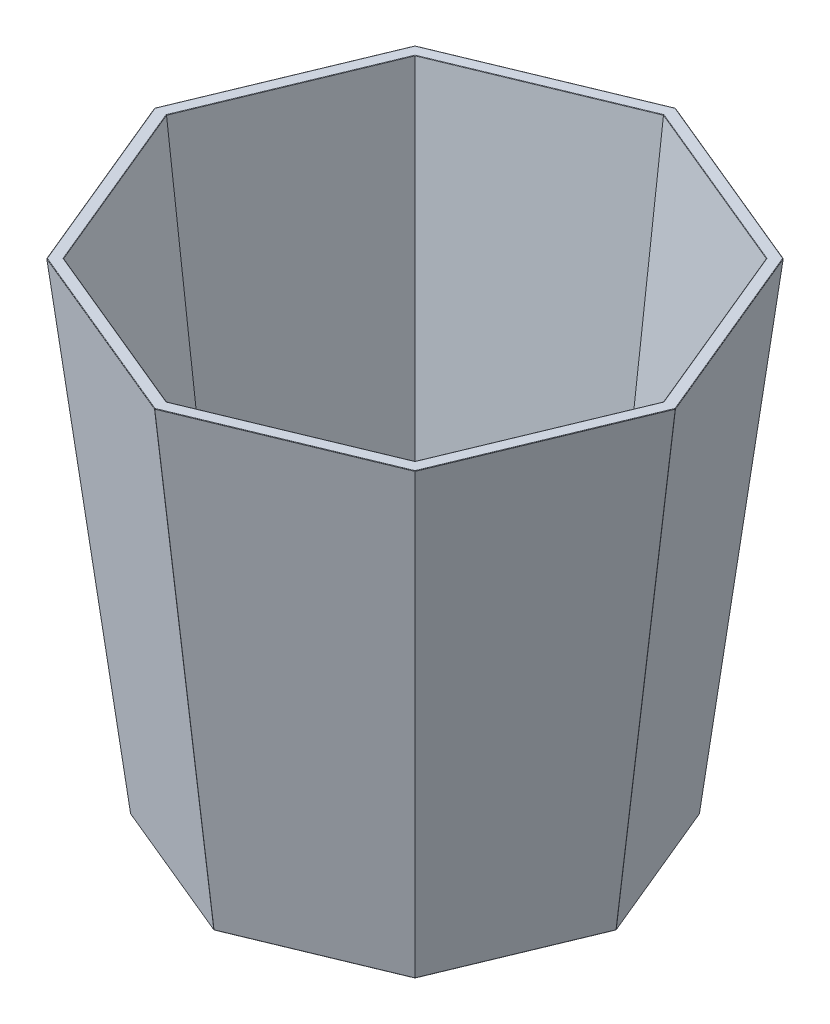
ISO-10303-21;
HEADER;
FILE_DESCRIPTION(('STEP AP214'),'2;1');
FILE_NAME('part.step','',(''),(''),'','','');
FILE_SCHEMA(('AUTOMOTIVE_DESIGN { 1 0 10303 214 1 1 1 1 }'));
ENDSEC;
DATA;
#1=APPLICATION_CONTEXT('core data for automotive mechanical design processes');
#2=APPLICATION_PROTOCOL_DEFINITION('international standard','automotive_design',2000,#1);
#3=PRODUCT_CONTEXT('',#1,'mechanical');
#4=PRODUCT('Part','Part','',(#3));
#5=PRODUCT_RELATED_PRODUCT_CATEGORY('part','',(#4));
#6=PRODUCT_DEFINITION_FORMATION('','',#4);
#7=PRODUCT_DEFINITION_CONTEXT('part definition',#1,'design');
#8=PRODUCT_DEFINITION('design','',#6,#7);
#9=PRODUCT_DEFINITION_SHAPE('','',#8);
#10=(LENGTH_UNIT() NAMED_UNIT(*) SI_UNIT(.MILLI.,.METRE.));
#11=(NAMED_UNIT(*) PLANE_ANGLE_UNIT() SI_UNIT($,.RADIAN.));
#12=(NAMED_UNIT(*) SI_UNIT($,.STERADIAN.) SOLID_ANGLE_UNIT());
#13=UNCERTAINTY_MEASURE_WITH_UNIT(LENGTH_MEASURE(1.E-05),#10,'distance_accuracy_value','');
#14=(GEOMETRIC_REPRESENTATION_CONTEXT(3) GLOBAL_UNCERTAINTY_ASSIGNED_CONTEXT((#13)) GLOBAL_UNIT_ASSIGNED_CONTEXT((#10,
#11,#12)) REPRESENTATION_CONTEXT('',''));
#15=CARTESIAN_POINT('',(0.,0.,0.));
#16=DIRECTION('',(0.,0.,1.));
#17=DIRECTION('',(1.,0.,0.));
#18=AXIS2_PLACEMENT_3D('',#15,#16,#17);
#19=CARTESIAN_POINT('',(42.0951775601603,0.,42.0951775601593));
#20=DIRECTION('',(0.917940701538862,-0.113203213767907,0.380223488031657));
#21=DIRECTION('',(0.382683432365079,0.,-0.923879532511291));
#22=AXIS2_PLACEMENT_3D('',#19,#20,#21);
#23=PLANE('',#22);
#24=DIRECTION('',(0.0865468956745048,0.992481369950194,0.0865468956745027));
#25=VECTOR('',#24,1.);
#26=CARTESIAN_POINT('',(42.111093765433,0.00191316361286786,42.0573220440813));
#27=LINE('',#26,#25);
#28=CARTESIAN_POINT('',(42.1012195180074,-0.111320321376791,42.0474477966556));
#29=VERTEX_POINT('',#28);
#30=CARTESIAN_POINT('',(32.5263807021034,-109.911320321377,32.4726089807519));
#31=VERTEX_POINT('',#30);
#32=EDGE_CURVE('E335',#29,#31,#27,.F.);
#33=ORIENTED_EDGE('',*,*,#32,.T.);
#34=DIRECTION('',(0.382683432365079,0.,-0.923879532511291));
#35=VECTOR('',#34,1.);
#36=CARTESIAN_POINT('',(45.9753741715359,-109.911320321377,0.00386654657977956));
#37=LINE('',#36,#35);
#38=CARTESIAN_POINT('',(45.9612263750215,-109.911320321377,0.0380223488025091));
#39=VERTEX_POINT('',#38);
#40=EDGE_CURVE('E338',#31,#39,#37,.T.);
#41=ORIENTED_EDGE('',*,*,#40,.T.);
#42=DIRECTION('',(0.122395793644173,0.992481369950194,0.));
#43=VECTOR('',#42,1.);
#44=CARTESIAN_POINT('',(59.2548476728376,-2.11618223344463,0.0380223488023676));
#45=LINE('',#44,#43);
#46=CARTESIAN_POINT('',(59.502093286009,-0.111320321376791,0.0380223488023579));
#47=VERTEX_POINT('',#46);
#48=EDGE_CURVE('E333',#39,#47,#45,.T.);
#49=ORIENTED_EDGE('',*,*,#48,.T.);
#50=DIRECTION('',(0.382683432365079,0.,-0.923879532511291));
#51=VECTOR('',#50,1.);
#52=CARTESIAN_POINT('',(42.0834596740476,-0.111320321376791,42.090323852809));
#53=LINE('',#52,#51);
#54=EDGE_CURVE('E331',#47,#29,#53,.F.);
#55=ORIENTED_EDGE('',*,*,#54,.T.);
#56=EDGE_LOOP('',(#33,#41,#49,#55));
#57=FACE_BOUND('',#56,.T.);
#58=ADVANCED_FACE('F34',(#57),#23,.T.);
#59=CARTESIAN_POINT('',(6.49172445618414E-13,0.,59.5315710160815));
#60=DIRECTION('',(0.380223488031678,-0.113203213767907,0.917940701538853));
#61=DIRECTION('',(0.923879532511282,0.,-0.3826834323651));
#62=AXIS2_PLACEMENT_3D('',#59,#60,#61);
#63=PLANE('',#62);
#64=DIRECTION('',(0.,0.992481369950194,0.122395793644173));
#65=VECTOR('',#64,1.);
#66=CARTESIAN_POINT('',(0.0380223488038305,0.00191316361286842,59.5160575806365));
#67=LINE('',#66,#65);
#68=CARTESIAN_POINT('',(0.0380223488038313,-0.111320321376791,59.5020932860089));
#69=VERTEX_POINT('',#68);
#70=CARTESIAN_POINT('',(0.0380223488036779,-109.911320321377,45.9612263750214));
#71=VERTEX_POINT('',#70);
#72=EDGE_CURVE('E324',#69,#71,#67,.F.);
#73=ORIENTED_EDGE('',*,*,#72,.T.);
#74=DIRECTION('',(0.923879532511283,0.,-0.3826834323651));
#75=VECTOR('',#74,1.);
#76=CARTESIAN_POINT('',(32.5067647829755,-109.911320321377,32.5122329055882));
#77=LINE('',#76,#75);
#78=CARTESIAN_POINT('',(32.4726089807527,-109.911320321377,32.5263807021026));
#79=VERTEX_POINT('',#78);
#80=EDGE_CURVE('E329',#71,#79,#77,.T.);
#81=ORIENTED_EDGE('',*,*,#80,.T.);
#82=DIRECTION('',(0.0865468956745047,0.992481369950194,0.0865468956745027));
#83=VECTOR('',#82,1.);
#84=CARTESIAN_POINT('',(41.8726187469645,-2.11618223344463,41.9263904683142));
#85=LINE('',#84,#83);
#86=CARTESIAN_POINT('',(42.0474477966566,-0.111320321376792,42.1012195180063));
#87=VERTEX_POINT('',#86);
#88=EDGE_CURVE('E326',#79,#87,#85,.T.);
#89=ORIENTED_EDGE('',*,*,#88,.T.);
#90=DIRECTION('',(0.923879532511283,0.,-0.3826834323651));
#91=VECTOR('',#90,1.);
#92=CARTESIAN_POINT('',(-0.00485370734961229,-0.111320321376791,59.5198531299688));
#93=LINE('',#92,#91);
#94=EDGE_CURVE('E273',#87,#69,#93,.F.);
#95=ORIENTED_EDGE('',*,*,#94,.T.);
#96=EDGE_LOOP('',(#73,#81,#89,#95));
#97=FACE_BOUND('',#96,.T.);
#98=ADVANCED_FACE('F670',(#97),#63,.T.);
#99=CARTESIAN_POINT('',(-42.0951775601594,0.,42.0951775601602));
#100=DIRECTION('',(-0.380223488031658,-0.113203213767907,0.917940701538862));
#101=DIRECTION('',(0.923879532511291,0.,0.382683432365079));
#102=AXIS2_PLACEMENT_3D('',#99,#100,#101);
#103=PLANE('',#102);
#104=DIRECTION('',(-0.0865468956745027,0.992481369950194,0.0865468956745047));
#105=VECTOR('',#104,1.);
#106=CARTESIAN_POINT('',(-42.0573220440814,0.00191316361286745,42.1110937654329));
#107=LINE('',#106,#105);
#108=CARTESIAN_POINT('',(-42.0474477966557,-0.11132032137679,42.1012195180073));
#109=VERTEX_POINT('',#108);
#110=CARTESIAN_POINT('',(-32.472608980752,-109.911320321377,32.5263807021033));
#111=VERTEX_POINT('',#110);
#112=EDGE_CURVE('E342',#109,#111,#107,.F.);
#113=ORIENTED_EDGE('',*,*,#112,.T.);
#114=DIRECTION('',(0.923879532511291,0.,0.382683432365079));
#115=VECTOR('',#114,1.);
#116=CARTESIAN_POINT('',(-0.00386654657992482,-109.911320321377,45.9753741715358));
#117=LINE('',#116,#115);
#118=CARTESIAN_POINT('',(-0.038022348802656,-109.911320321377,45.9612263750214));
#119=VERTEX_POINT('',#118);
#120=EDGE_CURVE('E347',#111,#119,#117,.T.);
#121=ORIENTED_EDGE('',*,*,#120,.T.);
#122=DIRECTION('',(0.,0.992481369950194,0.122395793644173));
#123=VECTOR('',#122,1.);
#124=CARTESIAN_POINT('',(-0.0380223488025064,-2.11618223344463,59.2548476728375));
#125=LINE('',#124,#123);
#126=CARTESIAN_POINT('',(-0.0380223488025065,-0.111320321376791,59.5020932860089));
#127=VERTEX_POINT('',#126);
#128=EDGE_CURVE('E344',#119,#127,#125,.T.);
#129=ORIENTED_EDGE('',*,*,#128,.T.);
#130=DIRECTION('',(0.923879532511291,0.,0.382683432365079));
#131=VECTOR('',#130,1.);
#132=CARTESIAN_POINT('',(-42.0903238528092,-0.11132032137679,42.0834596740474));
#133=LINE('',#132,#131);
#134=EDGE_CURVE('E340',#127,#109,#133,.F.);
#135=ORIENTED_EDGE('',*,*,#134,.T.);
#136=EDGE_LOOP('',(#113,#121,#129,#135));
#137=FACE_BOUND('',#136,.T.);
#138=ADVANCED_FACE('F676',(#137),#103,.T.);
#139=CARTESIAN_POINT('',(-59.5315710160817,0.,5.75800229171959E-13));
#140=DIRECTION('',(-0.917940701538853,-0.113203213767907,0.380223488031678));
#141=DIRECTION('',(0.3826834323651,0.,0.923879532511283));
#142=AXIS2_PLACEMENT_3D('',#139,#140,#141);
#143=PLANE('',#142);
#144=DIRECTION('',(-0.122395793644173,0.992481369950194,0.));
#145=VECTOR('',#144,1.);
#146=CARTESIAN_POINT('',(-59.5160575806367,0.00191316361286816,0.0380223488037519));
#147=LINE('',#146,#145);
#148=CARTESIAN_POINT('',(-59.5020932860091,-0.111320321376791,0.03802234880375));
#149=VERTEX_POINT('',#148);
#150=CARTESIAN_POINT('',(-45.9612263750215,-109.911320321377,0.0380223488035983));
#151=VERTEX_POINT('',#150);
#152=EDGE_CURVE('E351',#149,#151,#147,.F.);
#153=ORIENTED_EDGE('',*,*,#152,.T.);
#154=DIRECTION('',(0.3826834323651,0.,0.923879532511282));
#155=VECTOR('',#154,1.);
#156=CARTESIAN_POINT('',(-32.5122329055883,-109.911320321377,32.5067647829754));
#157=LINE('',#156,#155);
#158=CARTESIAN_POINT('',(-32.5263807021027,-109.911320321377,32.4726089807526));
#159=VERTEX_POINT('',#158);
#160=EDGE_CURVE('E356',#151,#159,#157,.T.);
#161=ORIENTED_EDGE('',*,*,#160,.T.);
#162=DIRECTION('',(-0.0865468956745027,0.992481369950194,0.0865468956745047));
#163=VECTOR('',#162,1.);
#164=CARTESIAN_POINT('',(-41.9263904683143,-2.11618223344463,41.8726187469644));
#165=LINE('',#164,#163);
#166=CARTESIAN_POINT('',(-42.1012195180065,-0.111320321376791,42.0474477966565));
#167=VERTEX_POINT('',#166);
#168=EDGE_CURVE('E353',#159,#167,#165,.T.);
#169=ORIENTED_EDGE('',*,*,#168,.T.);
#170=DIRECTION('',(0.3826834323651,0.,0.923879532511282));
#171=VECTOR('',#170,1.);
#172=CARTESIAN_POINT('',(-59.5198531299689,-0.111320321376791,-0.00485370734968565));
#173=LINE('',#172,#171);
#174=EDGE_CURVE('E349',#167,#149,#173,.F.);
#175=ORIENTED_EDGE('',*,*,#174,.T.);
#176=EDGE_LOOP('',(#153,#161,#169,#175));
#177=FACE_BOUND('',#176,.T.);
#178=ADVANCED_FACE('F698',(#177),#143,.T.);
#179=CARTESIAN_POINT('',(-42.0951775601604,0.,-42.0951775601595));
#180=DIRECTION('',(-0.917940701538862,-0.113203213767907,-0.380223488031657));
#181=DIRECTION('',(-0.382683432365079,0.,0.923879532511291));
#182=AXIS2_PLACEMENT_3D('',#179,#180,#181);
#183=PLANE('',#182);
#184=DIRECTION('',(-0.0865468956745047,0.992481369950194,-0.0865468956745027));
#185=VECTOR('',#184,1.);
#186=CARTESIAN_POINT('',(-42.1110937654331,0.00191316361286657,-42.0573220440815));
#187=LINE('',#186,#185);
#188=CARTESIAN_POINT('',(-42.1012195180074,-0.111320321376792,-42.0474477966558));
#189=VERTEX_POINT('',#188);
#190=CARTESIAN_POINT('',(-32.5263807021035,-109.911320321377,-32.4726089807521));
#191=VERTEX_POINT('',#190);
#192=EDGE_CURVE('E360',#189,#191,#187,.F.);
#193=ORIENTED_EDGE('',*,*,#192,.T.);
#194=DIRECTION('',(-0.382683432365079,0.,0.923879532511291));
#195=VECTOR('',#194,1.);
#196=CARTESIAN_POINT('',(-45.9753741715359,-109.911320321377,-0.00386654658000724));
#197=LINE('',#196,#195);
#198=CARTESIAN_POINT('',(-45.9612263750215,-109.911320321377,-0.0380223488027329));
#199=VERTEX_POINT('',#198);
#200=EDGE_CURVE('E365',#191,#199,#197,.T.);
#201=ORIENTED_EDGE('',*,*,#200,.T.);
#202=DIRECTION('',(-0.122395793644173,0.992481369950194,0.));
#203=VECTOR('',#202,1.);
#204=CARTESIAN_POINT('',(-59.2548476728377,-2.11618223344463,-0.0380223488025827));
#205=LINE('',#204,#203);
#206=CARTESIAN_POINT('',(-59.5020932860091,-0.111320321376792,-0.0380223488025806));
#207=VERTEX_POINT('',#206);
#208=EDGE_CURVE('E362',#199,#207,#205,.T.);
#209=ORIENTED_EDGE('',*,*,#208,.T.);
#210=DIRECTION('',(-0.382683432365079,0.,0.923879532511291));
#211=VECTOR('',#210,1.);
#212=CARTESIAN_POINT('',(-42.0834596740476,-0.111320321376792,-42.0903238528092));
#213=LINE('',#212,#211);
#214=EDGE_CURVE('E358',#207,#189,#213,.F.);
#215=ORIENTED_EDGE('',*,*,#214,.T.);
#216=EDGE_LOOP('',(#193,#201,#209,#215));
#217=FACE_BOUND('',#216,.T.);
#218=ADVANCED_FACE('F694',(#217),#183,.T.);
#219=CARTESIAN_POINT('',(-7.07839200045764E-13,0.,-59.5315710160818));
#220=DIRECTION('',(-0.380223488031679,-0.113203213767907,-0.917940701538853));
#221=DIRECTION('',(-0.923879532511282,0.,0.3826834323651));
#222=AXIS2_PLACEMENT_3D('',#219,#220,#221);
#223=PLANE('',#222);
#224=DIRECTION('',(0.,0.992481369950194,-0.122395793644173));
#225=VECTOR('',#224,1.);
#226=CARTESIAN_POINT('',(-0.0380223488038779,0.00191316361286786,-59.5160575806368));
#227=LINE('',#226,#225);
#228=CARTESIAN_POINT('',(-0.0380223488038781,-0.11132032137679,-59.5020932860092));
#229=VERTEX_POINT('',#228);
#230=CARTESIAN_POINT('',(-0.0380223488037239,-109.911320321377,-45.9612263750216));
#231=VERTEX_POINT('',#230);
#232=EDGE_CURVE('E369',#229,#231,#227,.F.);
#233=ORIENTED_EDGE('',*,*,#232,.T.);
#234=DIRECTION('',(-0.923879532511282,0.,0.3826834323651));
#235=VECTOR('',#234,1.);
#236=CARTESIAN_POINT('',(-32.5067647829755,-109.911320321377,-32.5122329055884));
#237=LINE('',#236,#235);
#238=CARTESIAN_POINT('',(-32.4726089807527,-109.911320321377,-32.5263807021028));
#239=VERTEX_POINT('',#238);
#240=EDGE_CURVE('E374',#231,#239,#237,.T.);
#241=ORIENTED_EDGE('',*,*,#240,.T.);
#242=DIRECTION('',(-0.0865468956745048,0.992481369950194,-0.0865468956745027));
#243=VECTOR('',#242,1.);
#244=CARTESIAN_POINT('',(-41.8726187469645,-2.11618223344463,-41.9263904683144));
#245=LINE('',#244,#243);
#246=CARTESIAN_POINT('',(-42.0474477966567,-0.11132032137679,-42.1012195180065));
#247=VERTEX_POINT('',#246);
#248=EDGE_CURVE('E371',#239,#247,#245,.T.);
#249=ORIENTED_EDGE('',*,*,#248,.T.);
#250=DIRECTION('',(-0.923879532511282,0.,0.3826834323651));
#251=VECTOR('',#250,1.);
#252=CARTESIAN_POINT('',(0.00485370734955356,-0.11132032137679,-59.519853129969));
#253=LINE('',#252,#251);
#254=EDGE_CURVE('E367',#247,#229,#253,.F.);
#255=ORIENTED_EDGE('',*,*,#254,.T.);
#256=EDGE_LOOP('',(#233,#241,#249,#255));
#257=FACE_BOUND('',#256,.T.);
#258=ADVANCED_FACE('F690',(#257),#223,.T.);
#259=CARTESIAN_POINT('',(42.0951775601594,0.,-42.0951775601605));
#260=DIRECTION('',(0.380223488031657,-0.113203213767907,-0.917940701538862));
#261=DIRECTION('',(-0.923879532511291,0.,-0.382683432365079));
#262=AXIS2_PLACEMENT_3D('',#259,#260,#261);
#263=PLANE('',#262);
#264=DIRECTION('',(0.0865468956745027,0.992481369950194,-0.0865468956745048));
#265=VECTOR('',#264,1.);
#266=CARTESIAN_POINT('',(42.0573220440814,0.00191316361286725,-42.1110937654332));
#267=LINE('',#266,#265);
#268=CARTESIAN_POINT('',(42.0474477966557,-0.111320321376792,-42.1012195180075));
#269=VERTEX_POINT('',#268);
#270=CARTESIAN_POINT('',(32.472608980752,-109.911320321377,-32.5263807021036));
#271=VERTEX_POINT('',#270);
#272=EDGE_CURVE('E378',#269,#271,#267,.F.);
#273=ORIENTED_EDGE('',*,*,#272,.T.);
#274=DIRECTION('',(-0.923879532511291,0.,-0.382683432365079));
#275=VECTOR('',#274,1.);
#276=CARTESIAN_POINT('',(0.00386654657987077,-109.911320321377,-45.975374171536));
#277=LINE('',#276,#275);
#278=CARTESIAN_POINT('',(0.0380223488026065,-109.911320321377,-45.9612263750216));
#279=VERTEX_POINT('',#278);
#280=EDGE_CURVE('E383',#271,#279,#277,.T.);
#281=ORIENTED_EDGE('',*,*,#280,.T.);
#282=DIRECTION('',(0.,0.992481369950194,-0.122395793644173));
#283=VECTOR('',#282,1.);
#284=CARTESIAN_POINT('',(0.0380223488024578,-2.11618223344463,-59.2548476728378));
#285=LINE('',#284,#283);
#286=CARTESIAN_POINT('',(0.0380223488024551,-0.111320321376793,-59.5020932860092));
#287=VERTEX_POINT('',#286);
#288=EDGE_CURVE('E380',#279,#287,#285,.T.);
#289=ORIENTED_EDGE('',*,*,#288,.T.);
#290=DIRECTION('',(-0.923879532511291,0.,-0.382683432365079));
#291=VECTOR('',#290,1.);
#292=CARTESIAN_POINT('',(42.0903238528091,-0.111320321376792,-42.0834596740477));
#293=LINE('',#292,#291);
#294=EDGE_CURVE('E376',#287,#269,#293,.F.);
#295=ORIENTED_EDGE('',*,*,#294,.T.);
#296=EDGE_LOOP('',(#273,#281,#289,#295));
#297=FACE_BOUND('',#296,.T.);
#298=ADVANCED_FACE('F686',(#297),#263,.T.);
#299=CARTESIAN_POINT('',(59.5315710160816,0.,-8.04911692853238E-13));
#300=DIRECTION('',(0.917940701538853,-0.113203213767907,-0.380223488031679));
#301=DIRECTION('',(-0.3826834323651,0.,-0.923879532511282));
#302=AXIS2_PLACEMENT_3D('',#299,#300,#301);
#303=PLANE('',#302);
#304=DIRECTION('',(0.122395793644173,0.992481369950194,0.));
#305=VECTOR('',#304,1.);
#306=CARTESIAN_POINT('',(59.5160575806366,0.00191316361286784,-0.0380223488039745));
#307=LINE('',#306,#305);
#308=CARTESIAN_POINT('',(59.502093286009,-0.111320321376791,-0.0380223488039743));
#309=VERTEX_POINT('',#308);
#310=CARTESIAN_POINT('',(45.9612263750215,-109.911320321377,-0.0380223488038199));
#311=VERTEX_POINT('',#310);
#312=EDGE_CURVE('E387',#309,#311,#307,.F.);
#313=ORIENTED_EDGE('',*,*,#312,.T.);
#314=DIRECTION('',(-0.3826834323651,0.,-0.923879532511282));
#315=VECTOR('',#314,1.);
#316=CARTESIAN_POINT('',(32.5122329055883,-109.911320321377,-32.5067647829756));
#317=LINE('',#316,#315);
#318=CARTESIAN_POINT('',(32.5263807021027,-109.911320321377,-32.4726089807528));
#319=VERTEX_POINT('',#318);
#320=EDGE_CURVE('E392',#311,#319,#317,.T.);
#321=ORIENTED_EDGE('',*,*,#320,.T.);
#322=DIRECTION('',(0.0865468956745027,0.992481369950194,-0.0865468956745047));
#323=VECTOR('',#322,1.);
#324=CARTESIAN_POINT('',(41.9263904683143,-2.11618223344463,-41.8726187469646));
#325=LINE('',#324,#323);
#326=CARTESIAN_POINT('',(42.1012195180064,-0.111320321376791,-42.0474477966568));
#327=VERTEX_POINT('',#326);
#328=EDGE_CURVE('E389',#319,#327,#325,.T.);
#329=ORIENTED_EDGE('',*,*,#328,.T.);
#330=DIRECTION('',(-0.3826834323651,0.,-0.923879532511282));
#331=VECTOR('',#330,1.);
#332=CARTESIAN_POINT('',(59.5198531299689,-0.111320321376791,0.00485370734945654));
#333=LINE('',#332,#331);
#334=EDGE_CURVE('E385',#327,#309,#333,.F.);
#335=ORIENTED_EDGE('',*,*,#334,.T.);
#336=EDGE_LOOP('',(#313,#321,#329,#335));
#337=FACE_BOUND('',#336,.T.);
#338=ADVANCED_FACE('F682',(#337),#303,.T.);
#339=CARTESIAN_POINT('',(0.,-110.,0.));
#340=DIRECTION('',(0.,1.,0.));
#341=DIRECTION('',(0.,0.,1.));
#342=AXIS2_PLACEMENT_3D('',#339,#340,#341);
#343=PLANE('',#342);
#344=DIRECTION('',(-0.923879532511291,0.,-0.382683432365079));
#345=VECTOR('',#344,1.);
#346=CARTESIAN_POINT('',(32.4687424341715,-110.,-32.4204388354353));
#347=LINE('',#346,#345);
#348=CARTESIAN_POINT('',(-5.62842608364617E-13,-110.,-45.8694323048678));
#349=VERTEX_POINT('',#348);
#350=CARTESIAN_POINT('',(32.4345866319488,-110.,-32.4345866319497));
#351=VERTEX_POINT('',#350);
#352=EDGE_CURVE('E409',#349,#351,#347,.F.);
#353=ORIENTED_EDGE('',*,*,#352,.T.);
#354=DIRECTION('',(-0.3826834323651,0.,-0.923879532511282));
#355=VECTOR('',#354,1.);
#356=CARTESIAN_POINT('',(45.883580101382,-110.,0.0341558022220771));
#357=LINE('',#356,#355);
#358=CARTESIAN_POINT('',(45.8694323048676,-110.,-6.520591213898E-13));
#359=VERTEX_POINT('',#358);
#360=EDGE_CURVE('E411',#351,#359,#357,.F.);
#361=ORIENTED_EDGE('',*,*,#360,.T.);
#362=DIRECTION('',(0.382683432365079,0.,-0.923879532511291));
#363=VECTOR('',#362,1.);
#364=CARTESIAN_POINT('',(32.4204388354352,-110.,32.4687424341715));
#365=LINE('',#364,#363);
#366=CARTESIAN_POINT('',(32.4345866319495,-110.,32.4345866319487));
#367=VERTEX_POINT('',#366);
#368=EDGE_CURVE('E397',#359,#367,#365,.F.);
#369=ORIENTED_EDGE('',*,*,#368,.T.);
#370=DIRECTION('',(0.923879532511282,0.,-0.3826834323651));
#371=VECTOR('',#370,1.);
#372=CARTESIAN_POINT('',(-0.0341558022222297,-110.,45.8835801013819));
#373=LINE('',#372,#371);
#374=CARTESIAN_POINT('',(5.02680190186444E-13,-110.,45.8694323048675));
#375=VERTEX_POINT('',#374);
#376=EDGE_CURVE('E399',#367,#375,#373,.F.);
#377=ORIENTED_EDGE('',*,*,#376,.T.);
#378=DIRECTION('',(0.923879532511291,0.,0.382683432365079));
#379=VECTOR('',#378,1.);
#380=CARTESIAN_POINT('',(-32.4687424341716,-110.,32.4204388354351));
#381=LINE('',#380,#379);
#382=CARTESIAN_POINT('',(-32.4345866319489,-110.,32.4345866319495));
#383=VERTEX_POINT('',#382);
#384=EDGE_CURVE('E401',#375,#383,#381,.F.);
#385=ORIENTED_EDGE('',*,*,#384,.T.);
#386=DIRECTION('',(0.3826834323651,0.,0.923879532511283));
#387=VECTOR('',#386,1.);
#388=CARTESIAN_POINT('',(-45.8835801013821,-110.,-0.0341558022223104));
#389=LINE('',#388,#387);
#390=CARTESIAN_POINT('',(-45.8694323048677,-110.,4.26476333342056E-13));
#391=VERTEX_POINT('',#390);
#392=EDGE_CURVE('E403',#383,#391,#389,.F.);
#393=ORIENTED_EDGE('',*,*,#392,.T.);
#394=DIRECTION('',(-0.382683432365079,0.,0.923879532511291));
#395=VECTOR('',#394,1.);
#396=CARTESIAN_POINT('',(-32.4204388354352,-110.,-32.4687424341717));
#397=LINE('',#396,#395);
#398=CARTESIAN_POINT('',(-32.4345866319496,-110.,-32.4345866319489));
#399=VERTEX_POINT('',#398);
#400=EDGE_CURVE('E405',#391,#399,#397,.F.);
#401=ORIENTED_EDGE('',*,*,#400,.T.);
#402=DIRECTION('',(-0.923879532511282,0.,0.3826834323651));
#403=VECTOR('',#402,1.);
#404=CARTESIAN_POINT('',(0.0341558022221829,-110.,-45.8835801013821));
#405=LINE('',#404,#403);
#406=EDGE_CURVE('E407',#399,#349,#405,.F.);
#407=ORIENTED_EDGE('',*,*,#406,.T.);
#408=EDGE_LOOP('',(#353,#361,#369,#377,#385,#393,#401,#407));
#409=FACE_BOUND('',#408,.T.);
#410=CARTESIAN_POINT('',(0.,-110.,0.));
#411=DIRECTION('',(0.,1.,0.));
#412=DIRECTION('',(0.,0.,1.));
#413=AXIS2_PLACEMENT_3D('',#410,#411,#412);
#414=CIRCLE('',#413,30.1);
#415=CARTESIAN_POINT('',(0.,-110.,30.1));
#416=VERTEX_POINT('',#415);
#417=EDGE_CURVE('E394',#416,#416,#414,.T.);
#418=ORIENTED_EDGE('',*,*,#417,.T.);
#419=EDGE_LOOP('',(#418));
#420=FACE_BOUND('',#419,.T.);
#421=ADVANCED_FACE('F685',(#409,#420),#343,.F.);
#422=CARTESIAN_POINT('',(0.,0.,0.));
#423=DIRECTION('',(0.,1.,0.));
#424=DIRECTION('',(0.,0.,1.));
#425=AXIS2_PLACEMENT_3D('',#422,#423,#424);
#426=PLANE('',#425);
#427=DIRECTION('',(0.923879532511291,0.,0.382683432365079));
#428=VECTOR('',#427,1.);
#429=CARTESIAN_POINT('',(-21.0047127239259,0.,50.7098623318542));
#430=LINE('',#429,#428);
#431=CARTESIAN_POINT('',(-42.0094254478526,0.,42.0094254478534));
#432=VERTEX_POINT('',#431);
#433=CARTESIAN_POINT('',(6.45649996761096E-13,0.,59.410299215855));
#434=VERTEX_POINT('',#433);
#435=EDGE_CURVE('E446',#432,#434,#430,.T.);
#436=ORIENTED_EDGE('',*,*,#435,.T.);
#437=DIRECTION('',(0.923879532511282,0.,-0.3826834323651));
#438=VECTOR('',#437,1.);
#439=CARTESIAN_POINT('',(21.004712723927,0.,50.7098623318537));
#440=LINE('',#439,#438);
#441=CARTESIAN_POINT('',(42.0094254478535,0.,42.0094254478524));
#442=VERTEX_POINT('',#441);
#443=EDGE_CURVE('E448',#434,#442,#440,.T.);
#444=ORIENTED_EDGE('',*,*,#443,.T.);
#445=DIRECTION('',(0.382683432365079,0.,-0.923879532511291));
#446=VECTOR('',#445,1.);
#447=CARTESIAN_POINT('',(50.7098623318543,0.,21.0047127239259));
#448=LINE('',#447,#446);
#449=CARTESIAN_POINT('',(59.4102992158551,0.,-8.04445219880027E-13));
#450=VERTEX_POINT('',#449);
#451=EDGE_CURVE('E434',#442,#450,#448,.T.);
#452=ORIENTED_EDGE('',*,*,#451,.T.);
#453=DIRECTION('',(-0.3826834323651,0.,-0.923879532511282));
#454=VECTOR('',#453,1.);
#455=CARTESIAN_POINT('',(50.7098623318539,0.,-21.0047127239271));
#456=LINE('',#455,#454);
#457=CARTESIAN_POINT('',(42.0094254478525,0.,-42.0094254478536));
#458=VERTEX_POINT('',#457);
#459=EDGE_CURVE('E436',#450,#458,#456,.T.);
#460=ORIENTED_EDGE('',*,*,#459,.T.);
#461=DIRECTION('',(-0.923879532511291,0.,-0.382683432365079));
#462=VECTOR('',#461,1.);
#463=CARTESIAN_POINT('',(21.0047127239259,0.,-50.7098623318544));
#464=LINE('',#463,#462);
#465=CARTESIAN_POINT('',(-7.21710043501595E-13,0.,-59.4102992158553));
#466=VERTEX_POINT('',#465);
#467=EDGE_CURVE('E438',#458,#466,#464,.T.);
#468=ORIENTED_EDGE('',*,*,#467,.T.);
#469=DIRECTION('',(-0.923879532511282,0.,0.3826834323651));
#470=VECTOR('',#469,1.);
#471=CARTESIAN_POINT('',(-21.0047127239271,0.,-50.709862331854));
#472=LINE('',#471,#470);
#473=CARTESIAN_POINT('',(-42.0094254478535,0.,-42.0094254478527));
#474=VERTEX_POINT('',#473);
#475=EDGE_CURVE('E440',#466,#474,#472,.T.);
#476=ORIENTED_EDGE('',*,*,#475,.T.);
#477=DIRECTION('',(-0.382683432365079,0.,0.923879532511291));
#478=VECTOR('',#477,1.);
#479=CARTESIAN_POINT('',(-50.7098623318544,0.,-21.0047127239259));
#480=LINE('',#479,#478);
#481=CARTESIAN_POINT('',(-59.4102992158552,0.,5.72453795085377E-13));
#482=VERTEX_POINT('',#481);
#483=EDGE_CURVE('E442',#474,#482,#480,.T.);
#484=ORIENTED_EDGE('',*,*,#483,.T.);
#485=DIRECTION('',(0.3826834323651,0.,0.923879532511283));
#486=VECTOR('',#485,1.);
#487=CARTESIAN_POINT('',(-50.7098623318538,0.,21.0047127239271));
#488=LINE('',#487,#486);
#489=EDGE_CURVE('E444',#482,#432,#488,.T.);
#490=ORIENTED_EDGE('',*,*,#489,.T.);
#491=EDGE_LOOP('',(#436,#444,#452,#460,#468,#476,#484,#490));
#492=FACE_BOUND('',#491,.T.);
#493=DIRECTION('',(-0.923879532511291,0.,-0.382683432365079));
#494=VECTOR('',#493,1.);
#495=CARTESIAN_POINT('',(40.2035369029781,0.,-40.2518405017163));
#496=LINE('',#495,#494);
#497=CARTESIAN_POINT('',(-6.60285272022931E-13,0.,-56.9046907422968));
#498=VERTEX_POINT('',#497);
#499=CARTESIAN_POINT('',(40.2376927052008,0.,-40.2376927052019));
#500=VERTEX_POINT('',#499);
#501=EDGE_CURVE('E429',#498,#500,#496,.F.);
#502=ORIENTED_EDGE('',*,*,#501,.T.);
#503=DIRECTION('',(-0.3826834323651,0.,-0.923879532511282));
#504=VECTOR('',#503,1.);
#505=CARTESIAN_POINT('',(56.8905429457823,0.,-0.0341558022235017));
#506=LINE('',#505,#504);
#507=CARTESIAN_POINT('',(56.9046907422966,0.,-7.7079891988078E-13));
#508=VERTEX_POINT('',#507);
#509=EDGE_CURVE('E431',#500,#508,#506,.F.);
#510=ORIENTED_EDGE('',*,*,#509,.T.);
#511=DIRECTION('',(0.382683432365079,0.,-0.923879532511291));
#512=VECTOR('',#511,1.);
#513=CARTESIAN_POINT('',(40.2518405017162,0.,40.203536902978));
#514=LINE('',#513,#512);
#515=CARTESIAN_POINT('',(40.2376927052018,0.,40.2376927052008));
#516=VERTEX_POINT('',#515);
#517=EDGE_CURVE('E417',#508,#516,#514,.F.);
#518=ORIENTED_EDGE('',*,*,#517,.T.);
#519=DIRECTION('',(0.923879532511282,0.,-0.3826834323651));
#520=VECTOR('',#519,1.);
#521=CARTESIAN_POINT('',(0.0341558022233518,0.,56.8905429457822));
#522=LINE('',#521,#520);
#523=CARTESIAN_POINT('',(6.13228104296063E-13,0.,56.9046907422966));
#524=VERTEX_POINT('',#523);
#525=EDGE_CURVE('E419',#516,#524,#522,.F.);
#526=ORIENTED_EDGE('',*,*,#525,.T.);
#527=DIRECTION('',(0.923879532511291,0.,0.382683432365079));
#528=VECTOR('',#527,1.);
#529=CARTESIAN_POINT('',(-40.2035369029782,0.,40.2518405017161));
#530=LINE('',#529,#528);
#531=CARTESIAN_POINT('',(-40.2376927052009,0.,40.2376927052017));
#532=VERTEX_POINT('',#531);
#533=EDGE_CURVE('E421',#524,#532,#530,.F.);
#534=ORIENTED_EDGE('',*,*,#533,.T.);
#535=DIRECTION('',(0.3826834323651,0.,0.923879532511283));
#536=VECTOR('',#535,1.);
#537=CARTESIAN_POINT('',(-56.8905429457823,0.,0.0341558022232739));
#538=LINE('',#537,#536);
#539=CARTESIAN_POINT('',(-56.9046907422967,0.,5.37966910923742E-13));
#540=VERTEX_POINT('',#539);
#541=EDGE_CURVE('E423',#532,#540,#538,.F.);
#542=ORIENTED_EDGE('',*,*,#541,.T.);
#543=DIRECTION('',(-0.382683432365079,0.,0.923879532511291));
#544=VECTOR('',#543,1.);
#545=CARTESIAN_POINT('',(-40.2518405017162,0.,-40.2035369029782));
#546=LINE('',#545,#544);
#547=CARTESIAN_POINT('',(-40.2376927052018,0.,-40.237692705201));
#548=VERTEX_POINT('',#547);
#549=EDGE_CURVE('E425',#540,#548,#546,.F.);
#550=ORIENTED_EDGE('',*,*,#549,.T.);
#551=DIRECTION('',(-0.923879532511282,0.,0.3826834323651));
#552=VECTOR('',#551,1.);
#553=CARTESIAN_POINT('',(-0.0341558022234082,0.,-56.8905429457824));
#554=LINE('',#553,#552);
#555=EDGE_CURVE('E427',#548,#498,#554,.F.);
#556=ORIENTED_EDGE('',*,*,#555,.T.);
#557=EDGE_LOOP('',(#502,#510,#518,#526,#534,#542,#550,#556));
#558=FACE_BOUND('',#557,.T.);
#559=ADVANCED_FACE('F633',(#492,#558),#426,.T.);
#560=CARTESIAN_POINT('',(39.8003258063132,0.283008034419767,41.1446188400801));
#561=DIRECTION('',(0.917940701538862,-0.113203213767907,0.380223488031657));
#562=DIRECTION('',(0.382683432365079,0.,-0.923879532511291));
#563=AXIS2_PLACEMENT_3D('',#560,#561,#562);
#564=PLANE('',#563);
#565=DIRECTION('',(0.0865468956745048,0.992481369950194,0.0865468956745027));
#566=VECTOR('',#565,1.);
#567=CARTESIAN_POINT('',(40.013527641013,-1.78725827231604,40.013527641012));
#568=LINE('',#567,#566);
#569=CARTESIAN_POINT('',(30.7951081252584,-107.5,30.7951081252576));
#570=VERTEX_POINT('',#569);
#571=CARTESIAN_POINT('',(40.1616480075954,-0.0886796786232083,40.1616480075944));
#572=VERTEX_POINT('',#571);
#573=EDGE_CURVE('E266',#570,#572,#568,.T.);
#574=ORIENTED_EDGE('',*,*,#573,.T.);
#575=DIRECTION('',(0.382683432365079,0.,-0.923879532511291));
#576=VECTOR('',#575,1.);
#577=CARTESIAN_POINT('',(56.7987488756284,-0.088679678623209,-0.0038665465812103));
#578=LINE('',#577,#576);
#579=CARTESIAN_POINT('',(56.7971472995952,-0.0886796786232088,-7.65662322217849E-13));
#580=VERTEX_POINT('',#579);
#581=EDGE_CURVE('E11',#572,#580,#578,.T.);
#582=ORIENTED_EDGE('',*,*,#581,.T.);
#583=DIRECTION('',(0.122395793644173,0.992481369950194,0.));
#584=VECTOR('',#583,1.);
#585=CARTESIAN_POINT('',(56.5876734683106,-1.78725827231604,-7.63278329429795E-13));
#586=LINE('',#585,#584);
#587=CARTESIAN_POINT('',(43.5508595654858,-107.5,-6.17924489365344E-13));
#588=VERTEX_POINT('',#587);
#589=EDGE_CURVE('E280',#588,#580,#586,.T.);
#590=ORIENTED_EDGE('',*,*,#589,.F.);
#591=DIRECTION('',(0.382683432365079,0.,-0.923879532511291));
#592=VECTOR('',#591,1.);
#593=CARTESIAN_POINT('',(37.1729838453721,-107.5,15.3975540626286));
#594=LINE('',#593,#592);
#595=EDGE_CURVE('E277',#570,#588,#594,.T.);
#596=ORIENTED_EDGE('',*,*,#595,.F.);
#597=EDGE_LOOP('',(#574,#582,#590,#596));
#598=FACE_BOUND('',#597,.T.);
#599=ADVANCED_FACE('F278',(#598),#564,.F.);
#600=CARTESIAN_POINT('',(-0.950558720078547,0.283008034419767,57.2367192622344));
#601=DIRECTION('',(0.380223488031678,-0.113203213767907,0.917940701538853));
#602=DIRECTION('',(0.923879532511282,0.,-0.3826834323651));
#603=AXIS2_PLACEMENT_3D('',#600,#601,#602);
#604=PLANE('',#603);
#605=DIRECTION('',(0.,0.992481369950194,0.122395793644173));
#606=VECTOR('',#605,1.);
#607=CARTESIAN_POINT('',(6.17561557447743E-13,-1.78725827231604,56.5876734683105));
#608=LINE('',#607,#606);
#609=CARTESIAN_POINT('',(4.70295064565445E-13,-107.5,43.5508595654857));
#610=VERTEX_POINT('',#609);
#611=CARTESIAN_POINT('',(6.19917320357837E-13,-0.0886796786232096,56.7971472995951));
#612=VERTEX_POINT('',#611);
#613=EDGE_CURVE('E274',#610,#612,#608,.T.);
#614=ORIENTED_EDGE('',*,*,#613,.T.);
#615=DIRECTION('',(0.923879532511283,0.,-0.3826834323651));
#616=VECTOR('',#615,1.);
#617=CARTESIAN_POINT('',(40.1655145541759,-0.088679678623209,40.1600464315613));
#618=LINE('',#617,#616);
#619=EDGE_CURVE('E43',#612,#572,#618,.T.);
#620=ORIENTED_EDGE('',*,*,#619,.T.);
#621=ORIENTED_EDGE('',*,*,#573,.F.);
#622=DIRECTION('',(0.923879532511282,0.,-0.3826834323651));
#623=VECTOR('',#622,1.);
#624=CARTESIAN_POINT('',(15.3975540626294,-107.5,37.1729838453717));
#625=LINE('',#624,#623);
#626=EDGE_CURVE('E270',#610,#570,#625,.T.);
#627=ORIENTED_EDGE('',*,*,#626,.F.);
#628=EDGE_LOOP('',(#614,#620,#621,#627));
#629=FACE_BOUND('',#628,.T.);
#630=ADVANCED_FACE('F268',(#629),#604,.F.);
#631=CARTESIAN_POINT('',(-41.1446188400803,0.283008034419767,39.8003258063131));
#632=DIRECTION('',(-0.380223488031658,-0.113203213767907,0.917940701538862));
#633=DIRECTION('',(0.923879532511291,0.,0.382683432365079));
#634=AXIS2_PLACEMENT_3D('',#631,#632,#633);
#635=PLANE('',#634);
#636=DIRECTION('',(-0.0865468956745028,0.992481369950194,0.0865468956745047));
#637=VECTOR('',#636,1.);
#638=CARTESIAN_POINT('',(-40.0135276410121,-1.78725827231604,40.0135276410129));
#639=LINE('',#638,#637);
#640=CARTESIAN_POINT('',(-30.7951081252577,-107.5,30.7951081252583));
#641=VERTEX_POINT('',#640);
#642=CARTESIAN_POINT('',(-40.1616480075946,-0.0886796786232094,40.1616480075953));
#643=VERTEX_POINT('',#642);
#644=EDGE_CURVE('E299',#641,#643,#639,.T.);
#645=ORIENTED_EDGE('',*,*,#644,.T.);
#646=DIRECTION('',(0.923879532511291,0.,0.382683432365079));
#647=VECTOR('',#646,1.);
#648=CARTESIAN_POINT('',(0.00386654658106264,-0.0886796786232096,56.7987488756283));
#649=LINE('',#648,#647);
#650=EDGE_CURVE('E58',#643,#612,#649,.T.);
#651=ORIENTED_EDGE('',*,*,#650,.T.);
#652=ORIENTED_EDGE('',*,*,#613,.F.);
#653=DIRECTION('',(0.923879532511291,0.,0.382683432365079));
#654=VECTOR('',#653,1.);
#655=CARTESIAN_POINT('',(-15.3975540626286,-107.5,37.172983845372));
#656=LINE('',#655,#654);
#657=EDGE_CURVE('E291',#641,#610,#656,.T.);
#658=ORIENTED_EDGE('',*,*,#657,.F.);
#659=EDGE_LOOP('',(#645,#651,#652,#658));
#660=FACE_BOUND('',#659,.T.);
#661=ADVANCED_FACE('F660',(#660),#635,.F.);
#662=CARTESIAN_POINT('',(-57.2367192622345,0.283008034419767,-0.95055872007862));
#663=DIRECTION('',(-0.917940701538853,-0.113203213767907,0.380223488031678));
#664=DIRECTION('',(0.3826834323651,0.,0.923879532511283));
#665=AXIS2_PLACEMENT_3D('',#662,#663,#664);
#666=PLANE('',#665);
#667=DIRECTION('',(-0.122395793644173,0.992481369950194,0.));
#668=VECTOR('',#667,1.);
#669=CARTESIAN_POINT('',(-56.5876734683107,-1.78725827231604,5.55111512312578E-13));
#670=LINE('',#669,#668);
#671=CARTESIAN_POINT('',(-43.5508595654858,-107.5,3.94397121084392E-13));
#672=VERTEX_POINT('',#671);
#673=CARTESIAN_POINT('',(-56.7971472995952,-0.0886796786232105,5.57471681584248E-13));
#674=VERTEX_POINT('',#673);
#675=EDGE_CURVE('E300',#672,#674,#670,.T.);
#676=ORIENTED_EDGE('',*,*,#675,.T.);
#677=DIRECTION('',(0.3826834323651,0.,0.923879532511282));
#678=VECTOR('',#677,1.);
#679=CARTESIAN_POINT('',(-40.1600464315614,-0.0886796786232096,40.1655145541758));
#680=LINE('',#679,#678);
#681=EDGE_CURVE('E460',#674,#643,#680,.T.);
#682=ORIENTED_EDGE('',*,*,#681,.T.);
#683=ORIENTED_EDGE('',*,*,#644,.F.);
#684=DIRECTION('',(0.3826834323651,0.,0.923879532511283));
#685=VECTOR('',#684,1.);
#686=CARTESIAN_POINT('',(-37.1729838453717,-107.5,15.3975540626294));
#687=LINE('',#686,#685);
#688=EDGE_CURVE('E295',#672,#641,#687,.T.);
#689=ORIENTED_EDGE('',*,*,#688,.F.);
#690=EDGE_LOOP('',(#676,#682,#683,#689));
#691=FACE_BOUND('',#690,.T.);
#692=ADVANCED_FACE('F659',(#691),#666,.F.);
#693=CARTESIAN_POINT('',(-39.8003258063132,0.283008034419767,-41.1446188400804));
#694=DIRECTION('',(-0.917940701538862,-0.113203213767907,-0.380223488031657));
#695=DIRECTION('',(-0.382683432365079,0.,0.923879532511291));
#696=AXIS2_PLACEMENT_3D('',#693,#694,#695);
#697=PLANE('',#696);
#698=DIRECTION('',(-0.0865468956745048,0.992481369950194,-0.0865468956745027));
#699=VECTOR('',#698,1.);
#700=CARTESIAN_POINT('',(-40.013527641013,-1.78725827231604,-40.0135276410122));
#701=LINE('',#700,#699);
#702=CARTESIAN_POINT('',(-30.7951081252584,-107.5,-30.7951081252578));
#703=VERTEX_POINT('',#702);
#704=CARTESIAN_POINT('',(-40.1616480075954,-0.088679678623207,-40.1616480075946));
#705=VERTEX_POINT('',#704);
#706=EDGE_CURVE('E304',#703,#705,#701,.T.);
#707=ORIENTED_EDGE('',*,*,#706,.T.);
#708=DIRECTION('',(-0.382683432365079,0.,0.923879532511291));
#709=VECTOR('',#708,1.);
#710=CARTESIAN_POINT('',(-56.7987488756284,-0.0886796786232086,0.00386654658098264));
#711=LINE('',#710,#709);
#712=EDGE_CURVE('E458',#705,#674,#711,.T.);
#713=ORIENTED_EDGE('',*,*,#712,.T.);
#714=ORIENTED_EDGE('',*,*,#675,.F.);
#715=DIRECTION('',(-0.382683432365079,0.,0.923879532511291));
#716=VECTOR('',#715,1.);
#717=CARTESIAN_POINT('',(-37.1729838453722,-107.5,-15.3975540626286));
#718=LINE('',#717,#716);
#719=EDGE_CURVE('E306',#703,#672,#718,.T.);
#720=ORIENTED_EDGE('',*,*,#719,.F.);
#721=EDGE_LOOP('',(#707,#713,#714,#720));
#722=FACE_BOUND('',#721,.T.);
#723=ADVANCED_FACE('F656',(#722),#697,.F.);
#724=CARTESIAN_POINT('',(0.950558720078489,0.283008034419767,-57.2367192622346));
#725=DIRECTION('',(-0.380223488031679,-0.113203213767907,-0.917940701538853));
#726=DIRECTION('',(-0.923879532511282,0.,0.3826834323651));
#727=AXIS2_PLACEMENT_3D('',#724,#725,#726);
#728=PLANE('',#727);
#729=DIRECTION('',(0.,0.992481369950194,-0.122395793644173));
#730=VECTOR('',#729,1.);
#731=CARTESIAN_POINT('',(-6.73072708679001E-13,-1.78725827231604,-56.5876734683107));
#732=LINE('',#731,#730);
#733=CARTESIAN_POINT('',(-5.22952955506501E-13,-107.5,-43.5508595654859));
#734=VERTEX_POINT('',#733);
#735=CARTESIAN_POINT('',(-6.75436561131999E-13,-0.088679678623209,-56.7971472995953));
#736=VERTEX_POINT('',#735);
#737=EDGE_CURVE('E309',#734,#736,#732,.T.);
#738=ORIENTED_EDGE('',*,*,#737,.T.);
#739=DIRECTION('',(-0.923879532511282,0.,0.3826834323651));
#740=VECTOR('',#739,1.);
#741=CARTESIAN_POINT('',(-40.1655145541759,-0.0886796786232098,-40.1600464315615));
#742=LINE('',#741,#740);
#743=EDGE_CURVE('E456',#736,#705,#742,.T.);
#744=ORIENTED_EDGE('',*,*,#743,.T.);
#745=ORIENTED_EDGE('',*,*,#706,.F.);
#746=DIRECTION('',(-0.923879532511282,0.,0.3826834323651));
#747=VECTOR('',#746,1.);
#748=CARTESIAN_POINT('',(-15.3975540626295,-107.5,-37.1729838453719));
#749=LINE('',#748,#747);
#750=EDGE_CURVE('E312',#734,#703,#749,.T.);
#751=ORIENTED_EDGE('',*,*,#750,.F.);
#752=EDGE_LOOP('',(#738,#744,#745,#751));
#753=FACE_BOUND('',#752,.T.);
#754=ADVANCED_FACE('F653',(#753),#728,.F.);
#755=CARTESIAN_POINT('',(41.1446188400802,0.283008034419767,-39.8003258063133));
#756=DIRECTION('',(0.380223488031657,-0.113203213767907,-0.917940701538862));
#757=DIRECTION('',(-0.923879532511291,0.,-0.382683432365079));
#758=AXIS2_PLACEMENT_3D('',#755,#756,#757);
#759=PLANE('',#758);
#760=DIRECTION('',(0.0865468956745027,0.992481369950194,-0.0865468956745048));
#761=VECTOR('',#760,1.);
#762=CARTESIAN_POINT('',(40.0135276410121,-1.78725827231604,-40.0135276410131));
#763=LINE('',#762,#761);
#764=CARTESIAN_POINT('',(30.7951081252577,-107.5,-30.7951081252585));
#765=VERTEX_POINT('',#764);
#766=CARTESIAN_POINT('',(40.1616480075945,-0.0886796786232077,-40.1616480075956));
#767=VERTEX_POINT('',#766);
#768=EDGE_CURVE('E293',#765,#767,#763,.T.);
#769=ORIENTED_EDGE('',*,*,#768,.T.);
#770=DIRECTION('',(-0.923879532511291,0.,-0.382683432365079));
#771=VECTOR('',#770,1.);
#772=CARTESIAN_POINT('',(-0.0038665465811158,-0.0886796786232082,-56.7987488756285));
#773=LINE('',#772,#771);
#774=EDGE_CURVE('E454',#767,#736,#773,.T.);
#775=ORIENTED_EDGE('',*,*,#774,.T.);
#776=ORIENTED_EDGE('',*,*,#737,.F.);
#777=DIRECTION('',(-0.923879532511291,0.,-0.382683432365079));
#778=VECTOR('',#777,1.);
#779=CARTESIAN_POINT('',(15.3975540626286,-107.5,-37.1729838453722));
#780=LINE('',#779,#778);
#781=EDGE_CURVE('E317',#765,#734,#780,.T.);
#782=ORIENTED_EDGE('',*,*,#781,.F.);
#783=EDGE_LOOP('',(#769,#775,#776,#782));
#784=FACE_BOUND('',#783,.T.);
#785=ADVANCED_FACE('F649',(#784),#759,.F.);
#786=CARTESIAN_POINT('',(57.2367192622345,0.283008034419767,0.950558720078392));
#787=DIRECTION('',(0.917940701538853,-0.113203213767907,-0.380223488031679));
#788=DIRECTION('',(-0.3826834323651,0.,-0.923879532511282));
#789=AXIS2_PLACEMENT_3D('',#786,#787,#788);
#790=PLANE('',#789);
#791=ORIENTED_EDGE('',*,*,#589,.T.);
#792=DIRECTION('',(-0.3826834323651,0.,-0.923879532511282));
#793=VECTOR('',#792,1.);
#794=CARTESIAN_POINT('',(40.1600464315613,-0.0886796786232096,-40.165514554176));
#795=LINE('',#794,#793);
#796=EDGE_CURVE('E451',#580,#767,#795,.T.);
#797=ORIENTED_EDGE('',*,*,#796,.T.);
#798=ORIENTED_EDGE('',*,*,#768,.F.);
#799=DIRECTION('',(-0.3826834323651,0.,-0.923879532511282));
#800=VECTOR('',#799,1.);
#801=CARTESIAN_POINT('',(37.1729838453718,-107.5,-15.3975540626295));
#802=LINE('',#801,#800);
#803=EDGE_CURVE('E284',#588,#765,#802,.T.);
#804=ORIENTED_EDGE('',*,*,#803,.F.);
#805=EDGE_LOOP('',(#791,#797,#798,#804));
#806=FACE_BOUND('',#805,.T.);
#807=ADVANCED_FACE('F645',(#806),#790,.F.);
#808=CARTESIAN_POINT('',(0.,-107.5,0.));
#809=DIRECTION('',(0.,1.,0.));
#810=DIRECTION('',(0.,0.,1.));
#811=AXIS2_PLACEMENT_3D('',#808,#809,#810);
#812=PLANE('',#811);
#813=CARTESIAN_POINT('',(0.,-107.5,0.));
#814=DIRECTION('',(0.,1.,0.));
#815=DIRECTION('',(0.,0.,1.));
#816=AXIS2_PLACEMENT_3D('',#813,#814,#815);
#817=CIRCLE('',#816,30.);
#818=CARTESIAN_POINT('',(0.,-107.5,30.));
#819=VERTEX_POINT('',#818);
#820=EDGE_CURVE('E285',#819,#819,#817,.T.);
#821=ORIENTED_EDGE('',*,*,#820,.F.);
#822=EDGE_LOOP('',(#821));
#823=FACE_BOUND('',#822,.T.);
#824=ORIENTED_EDGE('',*,*,#595,.T.);
#825=ORIENTED_EDGE('',*,*,#803,.T.);
#826=ORIENTED_EDGE('',*,*,#781,.T.);
#827=ORIENTED_EDGE('',*,*,#750,.T.);
#828=ORIENTED_EDGE('',*,*,#719,.T.);
#829=ORIENTED_EDGE('',*,*,#688,.T.);
#830=ORIENTED_EDGE('',*,*,#657,.T.);
#831=ORIENTED_EDGE('',*,*,#626,.T.);
#832=EDGE_LOOP('',(#824,#825,#826,#827,#828,#829,#830,#831));
#833=FACE_BOUND('',#832,.T.);
#834=ADVANCED_FACE('F288',(#823,#833),#812,.T.);
#835=CARTESIAN_POINT('',(0.,-217.5,0.));
#836=DIRECTION('',(0.,1.,0.));
#837=DIRECTION('',(0.,0.,1.));
#838=AXIS2_PLACEMENT_3D('',#835,#836,#837);
#839=CYLINDRICAL_SURFACE('',#838,30.);
#840=CARTESIAN_POINT('',(0.,-109.9,0.));
#841=DIRECTION('',(0.,1.,0.));
#842=DIRECTION('',(0.,0.,1.));
#843=AXIS2_PLACEMENT_3D('',#840,#841,#842);
#844=CIRCLE('',#843,30.);
#845=CARTESIAN_POINT('',(0.,-109.9,30.));
#846=VERTEX_POINT('',#845);
#847=EDGE_CURVE('E414',#846,#846,#844,.F.);
#848=ORIENTED_EDGE('',*,*,#847,.T.);
#849=EDGE_LOOP('',(#848));
#850=FACE_BOUND('',#849,.T.);
#851=ORIENTED_EDGE('',*,*,#820,.T.);
#852=EDGE_LOOP('',(#851));
#853=FACE_BOUND('',#852,.T.);
#854=ADVANCED_FACE('F866',(#850,#853),#839,.F.);
#855=CARTESIAN_POINT('',(-41.8345963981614,-2.10486191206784,-41.8345963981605));
#856=DIRECTION('',(-0.0865468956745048,0.992481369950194,-0.0865468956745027));
#857=DIRECTION('',(-0.996219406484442,-0.0868728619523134,0.));
#858=AXIS2_PLACEMENT_3D('',#855,#856,#857);
#859=CYLINDRICAL_SURFACE('',#858,0.1);
#860=CARTESIAN_POINT('',(-32.4345866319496,-109.9,-32.434586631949));
#861=DIRECTION('',(0.0865468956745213,-0.992481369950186,0.0865468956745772));
#862=DIRECTION('',(0.,-0.0868728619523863,-0.996219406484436));
#863=AXIS2_PLACEMENT_3D('',#860,#861,#862);
#864=CIRCLE('',#863,0.1);
#865=EDGE_CURVE('E599',#191,#239,#864,.T.);
#866=ORIENTED_EDGE('',*,*,#865,.F.);
#867=ORIENTED_EDGE('',*,*,#192,.F.);
#868=CARTESIAN_POINT('',(-42.0094254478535,-0.0999999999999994,-42.0094254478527));
#869=DIRECTION('',(-0.0865468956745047,0.992481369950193,-0.086546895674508));
#870=DIRECTION('',(0.,0.0868728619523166,0.996219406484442));
#871=AXIS2_PLACEMENT_3D('',#868,#869,#870);
#872=CIRCLE('',#871,0.1);
#873=EDGE_CURVE('E596',#247,#189,#872,.T.);
#874=ORIENTED_EDGE('',*,*,#873,.F.);
#875=ORIENTED_EDGE('',*,*,#248,.F.);
#876=EDGE_LOOP('',(#866,#867,#874,#875));
#877=FACE_BOUND('',#876,.T.);
#878=ADVANCED_FACE('F862',(#877),#859,.T.);
#879=CARTESIAN_POINT('',(-32.4345866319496,-109.9,-32.434586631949));
#880=DIRECTION('',(0.,0.,1.));
#881=DIRECTION('',(1.,0.,0.));
#882=AXIS2_PLACEMENT_3D('',#879,#880,#881);
#883=SPHERICAL_SURFACE('',#882,0.1);
#884=CARTESIAN_POINT('',(-32.4345866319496,-109.9,-32.4345866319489));
#885=DIRECTION('',(0.382683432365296,0.,-0.923879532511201));
#886=DIRECTION('',(-0.923879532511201,0.,-0.382683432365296));
#887=AXIS2_PLACEMENT_3D('',#884,#885,#886);
#888=CIRCLE('',#887,0.1);
#889=EDGE_CURVE('E590',#191,#399,#888,.F.);
#890=ORIENTED_EDGE('',*,*,#889,.F.);
#891=ORIENTED_EDGE('',*,*,#865,.T.);
#892=CARTESIAN_POINT('',(-32.4345866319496,-109.9,-32.434586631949));
#893=DIRECTION('',(-0.923879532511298,2.82982079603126E-13,0.382683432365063));
#894=DIRECTION('',(0.382683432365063,0.,0.923879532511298));
#895=AXIS2_PLACEMENT_3D('',#892,#893,#894);
#896=CIRCLE('',#895,0.1);
#897=EDGE_CURVE('E593',#399,#239,#896,.F.);
#898=ORIENTED_EDGE('',*,*,#897,.F.);
#899=EDGE_LOOP('',(#890,#891,#898));
#900=FACE_BOUND('',#899,.T.);
#901=ADVANCED_FACE('F858',(#900),#883,.T.);
#902=CARTESIAN_POINT('',(-42.0094254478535,-0.1,-42.0094254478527));
#903=DIRECTION('',(0.,0.,1.));
#904=DIRECTION('',(1.,0.,0.));
#905=AXIS2_PLACEMENT_3D('',#902,#903,#904);
#906=SPHERICAL_SURFACE('',#905,0.1);
#907=CARTESIAN_POINT('',(-42.0094254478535,-0.1,-42.0094254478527));
#908=DIRECTION('',(-0.92387953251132,0.,0.382683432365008));
#909=DIRECTION('',(0.382683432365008,0.,0.92387953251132));
#910=AXIS2_PLACEMENT_3D('',#907,#908,#909);
#911=CIRCLE('',#910,0.1);
#912=EDGE_CURVE('E584',#247,#474,#911,.F.);
#913=ORIENTED_EDGE('',*,*,#912,.F.);
#914=ORIENTED_EDGE('',*,*,#873,.T.);
#915=CARTESIAN_POINT('',(-42.0094254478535,-0.100000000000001,-42.0094254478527));
#916=DIRECTION('',(0.382683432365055,1.28214041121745E-13,-0.923879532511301));
#917=DIRECTION('',(-0.923879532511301,0.,-0.382683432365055));
#918=AXIS2_PLACEMENT_3D('',#915,#916,#917);
#919=CIRCLE('',#918,0.1);
#920=EDGE_CURVE('E587',#474,#189,#919,.F.);
#921=ORIENTED_EDGE('',*,*,#920,.F.);
#922=EDGE_LOOP('',(#913,#914,#921));
#923=FACE_BOUND('',#922,.T.);
#924=ADVANCED_FACE('F854',(#923),#906,.T.);
#925=CARTESIAN_POINT('',(4.83029546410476,-109.9,-47.8702061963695));
#926=DIRECTION('',(0.923879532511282,0.,-0.3826834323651));
#927=DIRECTION('',(-0.3826834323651,0.,-0.923879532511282));
#928=AXIS2_PLACEMENT_3D('',#925,#926,#927);
#929=CYLINDRICAL_SURFACE('',#928,0.1);
#930=ORIENTED_EDGE('',*,*,#897,.T.);
#931=ORIENTED_EDGE('',*,*,#240,.F.);
#932=CARTESIAN_POINT('',(-5.62842608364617E-13,-109.9,-45.8694323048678));
#933=DIRECTION('',(0.923879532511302,0.,-0.382683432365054));
#934=DIRECTION('',(-0.382683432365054,0.,-0.923879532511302));
#935=AXIS2_PLACEMENT_3D('',#932,#933,#934);
#936=CIRCLE('',#935,0.1);
#937=EDGE_CURVE('E578',#349,#231,#936,.T.);
#938=ORIENTED_EDGE('',*,*,#937,.F.);
#939=ORIENTED_EDGE('',*,*,#406,.F.);
#940=EDGE_LOOP('',(#930,#931,#938,#939));
#941=FACE_BOUND('',#940,.T.);
#942=ADVANCED_FACE('F850',(#941),#929,.T.);
#943=CARTESIAN_POINT('',(-30.433812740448,-109.9,-37.2648820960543));
#944=DIRECTION('',(0.382683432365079,0.,-0.923879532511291));
#945=DIRECTION('',(-0.923879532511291,0.,-0.382683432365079));
#946=AXIS2_PLACEMENT_3D('',#943,#944,#945);
#947=CYLINDRICAL_SURFACE('',#946,0.1);
#948=ORIENTED_EDGE('',*,*,#889,.T.);
#949=ORIENTED_EDGE('',*,*,#400,.F.);
#950=CARTESIAN_POINT('',(-45.8694323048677,-109.9,4.32799954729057E-13));
#951=DIRECTION('',(-0.382683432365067,0.,0.923879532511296));
#952=DIRECTION('',(0.923879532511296,0.,0.382683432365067));
#953=AXIS2_PLACEMENT_3D('',#950,#951,#952);
#954=CIRCLE('',#953,0.1);
#955=EDGE_CURVE('E575',#199,#391,#954,.T.);
#956=ORIENTED_EDGE('',*,*,#955,.F.);
#957=ORIENTED_EDGE('',*,*,#200,.F.);
#958=EDGE_LOOP('',(#948,#949,#956,#957));
#959=FACE_BOUND('',#958,.T.);
#960=ADVANCED_FACE('F846',(#959),#947,.T.);
#961=CARTESIAN_POINT('',(-59.1630536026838,-2.10486191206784,5.82867087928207E-13));
#962=DIRECTION('',(-0.122395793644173,0.992481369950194,0.));
#963=DIRECTION('',(-0.992481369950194,-0.122395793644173,0.));
#964=AXIS2_PLACEMENT_3D('',#961,#962,#963);
#965=CYLINDRICAL_SURFACE('',#964,0.1);
#966=CARTESIAN_POINT('',(-59.4102992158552,-0.100000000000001,5.85157465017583E-13));
#967=DIRECTION('',(-0.122395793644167,0.992481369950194,0.));
#968=DIRECTION('',(-0.992481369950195,-0.122395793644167,0.));
#969=AXIS2_PLACEMENT_3D('',#966,#967,#968);
#970=CIRCLE('',#969,0.1);
#971=EDGE_CURVE('E569',#207,#149,#970,.T.);
#972=ORIENTED_EDGE('',*,*,#971,.F.);
#973=ORIENTED_EDGE('',*,*,#208,.F.);
#974=CARTESIAN_POINT('',(-45.8694323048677,-109.9,4.30489248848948E-13));
#975=DIRECTION('',(0.122395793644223,-0.992481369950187,0.));
#976=DIRECTION('',(0.992481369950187,0.122395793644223,0.));
#977=AXIS2_PLACEMENT_3D('',#974,#975,#976);
#978=CIRCLE('',#977,0.1);
#979=EDGE_CURVE('E572',#151,#199,#978,.T.);
#980=ORIENTED_EDGE('',*,*,#979,.F.);
#981=ORIENTED_EDGE('',*,*,#152,.F.);
#982=EDGE_LOOP('',(#972,#973,#980,#981));
#983=FACE_BOUND('',#982,.T.);
#984=ADVANCED_FACE('F842',(#983),#965,.T.);
#985=CARTESIAN_POINT('',(-50.7098623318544,-0.1,-21.0047127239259));
#986=DIRECTION('',(-0.382683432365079,0.,0.923879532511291));
#987=DIRECTION('',(0.923879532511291,0.,0.382683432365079));
#988=AXIS2_PLACEMENT_3D('',#985,#986,#987);
#989=CYLINDRICAL_SURFACE('',#988,0.1);
#990=ORIENTED_EDGE('',*,*,#920,.T.);
#991=ORIENTED_EDGE('',*,*,#214,.F.);
#992=CARTESIAN_POINT('',(-59.4102992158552,-0.1,5.72453795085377E-13));
#993=DIRECTION('',(-0.382683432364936,0.,0.923879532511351));
#994=DIRECTION('',(0.923879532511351,0.,0.382683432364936));
#995=AXIS2_PLACEMENT_3D('',#992,#993,#994);
#996=CIRCLE('',#995,0.1);
#997=EDGE_CURVE('E567',#482,#207,#996,.T.);
#998=ORIENTED_EDGE('',*,*,#997,.F.);
#999=ORIENTED_EDGE('',*,*,#483,.F.);
#1000=EDGE_LOOP('',(#990,#991,#998,#999));
#1001=FACE_BOUND('',#1000,.T.);
#1002=ADVANCED_FACE('F838',(#1001),#989,.T.);
#1003=CARTESIAN_POINT('',(-21.0047127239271,-0.1,-50.709862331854));
#1004=DIRECTION('',(-0.923879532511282,0.,0.3826834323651));
#1005=DIRECTION('',(0.3826834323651,0.,0.923879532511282));
#1006=AXIS2_PLACEMENT_3D('',#1003,#1004,#1005);
#1007=CYLINDRICAL_SURFACE('',#1006,0.1);
#1008=ORIENTED_EDGE('',*,*,#912,.T.);
#1009=ORIENTED_EDGE('',*,*,#475,.F.);
#1010=CARTESIAN_POINT('',(-7.1024051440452E-13,-0.0999999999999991,-59.4102992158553));
#1011=DIRECTION('',(0.923879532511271,1.39083041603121E-13,-0.382683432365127));
#1012=DIRECTION('',(-0.382683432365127,0.,-0.923879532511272));
#1013=AXIS2_PLACEMENT_3D('',#1010,#1011,#1012);
#1014=CIRCLE('',#1013,0.1);
#1015=EDGE_CURVE('E564',#229,#466,#1014,.T.);
#1016=ORIENTED_EDGE('',*,*,#1015,.F.);
#1017=ORIENTED_EDGE('',*,*,#254,.F.);
#1018=EDGE_LOOP('',(#1008,#1009,#1016,#1017));
#1019=FACE_BOUND('',#1018,.T.);
#1020=ADVANCED_FACE('F834',(#1019),#1007,.T.);
#1021=CARTESIAN_POINT('',(-7.07767178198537E-13,-2.10486191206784,-59.1630536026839));
#1022=DIRECTION('',(0.,0.992481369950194,-0.122395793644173));
#1023=DIRECTION('',(0.,0.122395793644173,0.992481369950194));
#1024=AXIS2_PLACEMENT_3D('',#1021,#1022,#1023);
#1025=CYLINDRICAL_SURFACE('',#1024,0.1);
#1026=CARTESIAN_POINT('',(-5.56066965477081E-13,-109.9,-45.8694323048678));
#1027=DIRECTION('',(0.,-0.992481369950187,0.122395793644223));
#1028=DIRECTION('',(0.,-0.122395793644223,-0.992481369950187));
#1029=AXIS2_PLACEMENT_3D('',#1026,#1027,#1028);
#1030=CIRCLE('',#1029,0.1);
#1031=EDGE_CURVE('E581',#231,#279,#1030,.T.);
#1032=ORIENTED_EDGE('',*,*,#1031,.F.);
#1033=ORIENTED_EDGE('',*,*,#232,.F.);
#1034=CARTESIAN_POINT('',(-7.1061998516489E-13,-0.100000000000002,-59.4102992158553));
#1035=DIRECTION('',(0.,0.992481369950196,-0.122395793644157));
#1036=DIRECTION('',(0.,0.122395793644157,0.992481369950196));
#1037=AXIS2_PLACEMENT_3D('',#1034,#1035,#1036);
#1038=CIRCLE('',#1037,0.1);
#1039=EDGE_CURVE('E561',#287,#229,#1038,.T.);
#1040=ORIENTED_EDGE('',*,*,#1039,.F.);
#1041=ORIENTED_EDGE('',*,*,#288,.F.);
#1042=EDGE_LOOP('',(#1032,#1033,#1040,#1041));
#1043=FACE_BOUND('',#1042,.T.);
#1044=ADVANCED_FACE('F830',(#1043),#1025,.T.);
#1045=CARTESIAN_POINT('',(-5.59389386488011E-13,-109.9,-45.8694323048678));
#1046=DIRECTION('',(0.,0.,1.));
#1047=DIRECTION('',(1.,0.,0.));
#1048=AXIS2_PLACEMENT_3D('',#1045,#1046,#1047);
#1049=SPHERICAL_SURFACE('',#1048,0.1);
#1050=ORIENTED_EDGE('',*,*,#937,.T.);
#1051=ORIENTED_EDGE('',*,*,#1031,.T.);
#1052=CARTESIAN_POINT('',(-5.59258585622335E-13,-109.9,-45.8694323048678));
#1053=DIRECTION('',(-0.923879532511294,0.,-0.382683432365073));
#1054=DIRECTION('',(-0.382683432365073,0.,0.923879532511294));
#1055=AXIS2_PLACEMENT_3D('',#1052,#1053,#1054);
#1056=CIRCLE('',#1055,0.1);
#1057=EDGE_CURVE('E558',#349,#279,#1056,.F.);
#1058=ORIENTED_EDGE('',*,*,#1057,.F.);
#1059=EDGE_LOOP('',(#1050,#1051,#1058));
#1060=FACE_BOUND('',#1059,.T.);
#1061=ADVANCED_FACE('F826',(#1060),#1049,.T.);
#1062=CARTESIAN_POINT('',(-45.8694323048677,-109.9,4.2992184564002E-13));
#1063=DIRECTION('',(0.,0.,1.));
#1064=DIRECTION('',(1.,0.,0.));
#1065=AXIS2_PLACEMENT_3D('',#1062,#1063,#1064);
#1066=SPHERICAL_SURFACE('',#1065,0.1);
#1067=ORIENTED_EDGE('',*,*,#979,.T.);
#1068=ORIENTED_EDGE('',*,*,#955,.T.);
#1069=CARTESIAN_POINT('',(-45.8694323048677,-109.9,4.26476333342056E-13));
#1070=DIRECTION('',(-0.382683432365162,0.,-0.923879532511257));
#1071=DIRECTION('',(-0.923879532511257,0.,0.382683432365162));
#1072=AXIS2_PLACEMENT_3D('',#1069,#1070,#1071);
#1073=CIRCLE('',#1072,0.1);
#1074=EDGE_CURVE('E555',#151,#391,#1073,.F.);
#1075=ORIENTED_EDGE('',*,*,#1074,.F.);
#1076=EDGE_LOOP('',(#1067,#1068,#1075));
#1077=FACE_BOUND('',#1076,.T.);
#1078=ADVANCED_FACE('F822',(#1077),#1066,.T.);
#1079=CARTESIAN_POINT('',(-59.4102992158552,-0.1,5.74079208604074E-13));
#1080=DIRECTION('',(0.,0.,1.));
#1081=DIRECTION('',(1.,0.,0.));
#1082=AXIS2_PLACEMENT_3D('',#1079,#1080,#1081);
#1083=SPHERICAL_SURFACE('',#1082,0.1);
#1084=ORIENTED_EDGE('',*,*,#997,.T.);
#1085=ORIENTED_EDGE('',*,*,#971,.T.);
#1086=CARTESIAN_POINT('',(-59.4102992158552,-0.1,5.82209790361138E-13));
#1087=DIRECTION('',(-0.382683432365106,0.,-0.92387953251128));
#1088=DIRECTION('',(-0.92387953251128,0.,0.382683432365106));
#1089=AXIS2_PLACEMENT_3D('',#1086,#1087,#1088);
#1090=CIRCLE('',#1089,0.1);
#1091=EDGE_CURVE('E552',#482,#149,#1090,.F.);
#1092=ORIENTED_EDGE('',*,*,#1091,.F.);
#1093=EDGE_LOOP('',(#1084,#1085,#1092));
#1094=FACE_BOUND('',#1093,.T.);
#1095=ADVANCED_FACE('F818',(#1094),#1083,.T.);
#1096=CARTESIAN_POINT('',(-7.07965920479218E-13,-0.1,-59.4102992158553));
#1097=DIRECTION('',(0.,0.,1.));
#1098=DIRECTION('',(1.,0.,0.));
#1099=AXIS2_PLACEMENT_3D('',#1096,#1097,#1098);
#1100=SPHERICAL_SURFACE('',#1099,0.1);
#1101=ORIENTED_EDGE('',*,*,#1039,.T.);
#1102=ORIENTED_EDGE('',*,*,#1015,.T.);
#1103=CARTESIAN_POINT('',(-7.21710043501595E-13,-0.1,-59.4102992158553));
#1104=DIRECTION('',(-0.923879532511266,0.,-0.38268343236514));
#1105=DIRECTION('',(-0.38268343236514,0.,0.923879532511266));
#1106=AXIS2_PLACEMENT_3D('',#1103,#1104,#1105);
#1107=CIRCLE('',#1106,0.1);
#1108=EDGE_CURVE('E549',#287,#466,#1107,.F.);
#1109=ORIENTED_EDGE('',*,*,#1108,.F.);
#1110=EDGE_LOOP('',(#1101,#1102,#1109));
#1111=FACE_BOUND('',#1110,.T.);
#1112=ADVANCED_FACE('F814',(#1111),#1100,.T.);
#1113=CARTESIAN_POINT('',(37.2648820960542,-109.9,-30.4338127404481));
#1114=DIRECTION('',(0.923879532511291,0.,0.382683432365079));
#1115=DIRECTION('',(0.382683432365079,0.,-0.923879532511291));
#1116=AXIS2_PLACEMENT_3D('',#1113,#1114,#1115);
#1117=CYLINDRICAL_SURFACE('',#1116,0.1);
#1118=ORIENTED_EDGE('',*,*,#1057,.T.);
#1119=ORIENTED_EDGE('',*,*,#280,.F.);
#1120=CARTESIAN_POINT('',(32.4345866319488,-109.9,-32.4345866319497));
#1121=DIRECTION('',(0.923879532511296,0.,0.382683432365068));
#1122=DIRECTION('',(0.382683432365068,0.,-0.923879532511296));
#1123=AXIS2_PLACEMENT_3D('',#1120,#1121,#1122);
#1124=CIRCLE('',#1123,0.1);
#1125=EDGE_CURVE('E543',#351,#271,#1124,.T.);
#1126=ORIENTED_EDGE('',*,*,#1125,.F.);
#1127=ORIENTED_EDGE('',*,*,#352,.F.);
#1128=EDGE_LOOP('',(#1118,#1119,#1126,#1127));
#1129=FACE_BOUND('',#1128,.T.);
#1130=ADVANCED_FACE('F810',(#1129),#1117,.T.);
#1131=CARTESIAN_POINT('',(-47.8702061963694,-109.9,-4.83029546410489));
#1132=DIRECTION('',(-0.3826834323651,0.,-0.923879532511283));
#1133=DIRECTION('',(-0.923879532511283,0.,0.3826834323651));
#1134=AXIS2_PLACEMENT_3D('',#1131,#1132,#1133);
#1135=CYLINDRICAL_SURFACE('',#1134,0.1);
#1136=ORIENTED_EDGE('',*,*,#1074,.T.);
#1137=ORIENTED_EDGE('',*,*,#392,.F.);
#1138=CARTESIAN_POINT('',(-32.4345866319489,-109.9,32.4345866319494));
#1139=DIRECTION('',(0.382683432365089,0.,0.923879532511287));
#1140=DIRECTION('',(0.923879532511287,0.,-0.382683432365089));
#1141=AXIS2_PLACEMENT_3D('',#1138,#1139,#1140);
#1142=CIRCLE('',#1141,0.1);
#1143=EDGE_CURVE('E540',#159,#383,#1142,.T.);
#1144=ORIENTED_EDGE('',*,*,#1143,.F.);
#1145=ORIENTED_EDGE('',*,*,#160,.F.);
#1146=EDGE_LOOP('',(#1136,#1137,#1144,#1145));
#1147=FACE_BOUND('',#1146,.T.);
#1148=ADVANCED_FACE('F806',(#1147),#1135,.T.);
#1149=CARTESIAN_POINT('',(-41.8345963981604,-2.10486191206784,41.8345963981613));
#1150=DIRECTION('',(-0.0865468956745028,0.992481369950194,0.0865468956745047));
#1151=DIRECTION('',(0.,-0.0868728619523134,0.996219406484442));
#1152=AXIS2_PLACEMENT_3D('',#1149,#1150,#1151);
#1153=CYLINDRICAL_SURFACE('',#1152,0.1);
#1154=CARTESIAN_POINT('',(-42.0094254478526,-0.1,42.0094254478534));
#1155=DIRECTION('',(-0.0865468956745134,0.992481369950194,0.0865468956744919));
#1156=DIRECTION('',(-0.996219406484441,-0.086872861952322,0.));
#1157=AXIS2_PLACEMENT_3D('',#1154,#1155,#1156);
#1158=CIRCLE('',#1157,0.1);
#1159=EDGE_CURVE('E534',#167,#109,#1158,.T.);
#1160=ORIENTED_EDGE('',*,*,#1159,.F.);
#1161=ORIENTED_EDGE('',*,*,#168,.F.);
#1162=CARTESIAN_POINT('',(-32.4345866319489,-109.9,32.4345866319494));
#1163=DIRECTION('',(0.0865468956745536,-0.992481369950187,-0.0865468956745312));
#1164=DIRECTION('',(0.996219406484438,0.0868728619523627,0.));
#1165=AXIS2_PLACEMENT_3D('',#1162,#1163,#1164);
#1166=CIRCLE('',#1165,0.1);
#1167=EDGE_CURVE('E537',#111,#159,#1166,.T.);
#1168=ORIENTED_EDGE('',*,*,#1167,.F.);
#1169=ORIENTED_EDGE('',*,*,#112,.F.);
#1170=EDGE_LOOP('',(#1160,#1161,#1168,#1169));
#1171=FACE_BOUND('',#1170,.T.);
#1172=ADVANCED_FACE('F802',(#1171),#1153,.T.);
#1173=CARTESIAN_POINT('',(-50.7098623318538,-0.1,21.0047127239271));
#1174=DIRECTION('',(0.3826834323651,0.,0.923879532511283));
#1175=DIRECTION('',(0.923879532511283,0.,-0.3826834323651));
#1176=AXIS2_PLACEMENT_3D('',#1173,#1174,#1175);
#1177=CYLINDRICAL_SURFACE('',#1176,0.1);
#1178=ORIENTED_EDGE('',*,*,#1091,.T.);
#1179=ORIENTED_EDGE('',*,*,#174,.F.);
#1180=CARTESIAN_POINT('',(-42.0094254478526,-0.1,42.0094254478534));
#1181=DIRECTION('',(0.382683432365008,0.,0.92387953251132));
#1182=DIRECTION('',(0.92387953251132,0.,-0.382683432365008));
#1183=AXIS2_PLACEMENT_3D('',#1180,#1181,#1182);
#1184=CIRCLE('',#1183,0.1);
#1185=EDGE_CURVE('E532',#432,#167,#1184,.T.);
#1186=ORIENTED_EDGE('',*,*,#1185,.F.);
#1187=ORIENTED_EDGE('',*,*,#489,.F.);
#1188=EDGE_LOOP('',(#1178,#1179,#1186,#1187));
#1189=FACE_BOUND('',#1188,.T.);
#1190=ADVANCED_FACE('F798',(#1189),#1177,.T.);
#1191=CARTESIAN_POINT('',(21.0047127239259,-0.1,-50.7098623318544));
#1192=DIRECTION('',(-0.923879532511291,0.,-0.382683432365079));
#1193=DIRECTION('',(-0.382683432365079,0.,0.923879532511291));
#1194=AXIS2_PLACEMENT_3D('',#1191,#1192,#1193);
#1195=CYLINDRICAL_SURFACE('',#1194,0.1);
#1196=ORIENTED_EDGE('',*,*,#1108,.T.);
#1197=ORIENTED_EDGE('',*,*,#467,.F.);
#1198=CARTESIAN_POINT('',(42.0094254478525,-0.100000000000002,-42.0094254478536));
#1199=DIRECTION('',(0.923879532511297,0.,0.382683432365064));
#1200=DIRECTION('',(0.382683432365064,0.,-0.923879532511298));
#1201=AXIS2_PLACEMENT_3D('',#1198,#1199,#1200);
#1202=CIRCLE('',#1201,0.1);
#1203=EDGE_CURVE('E529',#269,#458,#1202,.T.);
#1204=ORIENTED_EDGE('',*,*,#1203,.F.);
#1205=ORIENTED_EDGE('',*,*,#294,.F.);
#1206=EDGE_LOOP('',(#1196,#1197,#1204,#1205));
#1207=FACE_BOUND('',#1206,.T.);
#1208=ADVANCED_FACE('F794',(#1207),#1195,.T.);
#1209=CARTESIAN_POINT('',(41.8345963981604,-2.10486191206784,-41.8345963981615));
#1210=DIRECTION('',(0.0865468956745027,0.992481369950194,-0.0865468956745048));
#1211=DIRECTION('',(0.,0.0868728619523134,0.996219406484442));
#1212=AXIS2_PLACEMENT_3D('',#1209,#1210,#1211);
#1213=CYLINDRICAL_SURFACE('',#1212,0.1);
#1214=CARTESIAN_POINT('',(32.4345866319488,-109.9,-32.4345866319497));
#1215=DIRECTION('',(-0.0865468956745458,-0.992481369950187,0.0865468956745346));
#1216=DIRECTION('',(0.996219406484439,-0.0868728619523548,0.));
#1217=AXIS2_PLACEMENT_3D('',#1214,#1215,#1216);
#1218=CIRCLE('',#1217,0.1);
#1219=EDGE_CURVE('E546',#271,#319,#1218,.T.);
#1220=ORIENTED_EDGE('',*,*,#1219,.F.);
#1221=ORIENTED_EDGE('',*,*,#272,.F.);
#1222=CARTESIAN_POINT('',(42.0094254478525,-0.1,-42.0094254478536));
#1223=DIRECTION('',(0.0865468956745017,0.992481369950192,-0.0865468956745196));
#1224=DIRECTION('',(0.,0.0868728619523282,0.996219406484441));
#1225=AXIS2_PLACEMENT_3D('',#1222,#1223,#1224);
#1226=CIRCLE('',#1225,0.1);
#1227=EDGE_CURVE('E526',#327,#269,#1226,.T.);
#1228=ORIENTED_EDGE('',*,*,#1227,.F.);
#1229=ORIENTED_EDGE('',*,*,#328,.F.);
#1230=EDGE_LOOP('',(#1220,#1221,#1228,#1229));
#1231=FACE_BOUND('',#1230,.T.);
#1232=ADVANCED_FACE('F790',(#1231),#1213,.T.);
#1233=CARTESIAN_POINT('',(32.4345866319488,-109.9,-32.4345866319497));
#1234=DIRECTION('',(0.,0.,1.));
#1235=DIRECTION('',(1.,0.,0.));
#1236=AXIS2_PLACEMENT_3D('',#1233,#1234,#1235);
#1237=SPHERICAL_SURFACE('',#1236,0.1);
#1238=ORIENTED_EDGE('',*,*,#1125,.T.);
#1239=ORIENTED_EDGE('',*,*,#1219,.T.);
#1240=CARTESIAN_POINT('',(32.4345866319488,-109.9,-32.4345866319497));
#1241=DIRECTION('',(-0.382683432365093,0.,-0.923879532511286));
#1242=DIRECTION('',(-0.923879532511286,0.,0.382683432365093));
#1243=AXIS2_PLACEMENT_3D('',#1240,#1241,#1242);
#1244=CIRCLE('',#1243,0.1);
#1245=EDGE_CURVE('E523',#351,#319,#1244,.F.);
#1246=ORIENTED_EDGE('',*,*,#1245,.F.);
#1247=EDGE_LOOP('',(#1238,#1239,#1246));
#1248=FACE_BOUND('',#1247,.T.);
#1249=ADVANCED_FACE('F786',(#1248),#1237,.T.);
#1250=CARTESIAN_POINT('',(-32.4345866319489,-109.9,32.4345866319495));
#1251=DIRECTION('',(0.,0.,1.));
#1252=DIRECTION('',(1.,0.,0.));
#1253=AXIS2_PLACEMENT_3D('',#1250,#1251,#1252);
#1254=SPHERICAL_SURFACE('',#1253,0.1);
#1255=ORIENTED_EDGE('',*,*,#1167,.T.);
#1256=ORIENTED_EDGE('',*,*,#1143,.T.);
#1257=CARTESIAN_POINT('',(-32.4345866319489,-109.9,32.4345866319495));
#1258=DIRECTION('',(-0.923879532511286,0.,-0.382683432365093));
#1259=DIRECTION('',(-0.382683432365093,0.,0.923879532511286));
#1260=AXIS2_PLACEMENT_3D('',#1257,#1258,#1259);
#1261=CIRCLE('',#1260,0.1);
#1262=EDGE_CURVE('E520',#111,#383,#1261,.F.);
#1263=ORIENTED_EDGE('',*,*,#1262,.F.);
#1264=EDGE_LOOP('',(#1255,#1256,#1263));
#1265=FACE_BOUND('',#1264,.T.);
#1266=ADVANCED_FACE('F782',(#1265),#1254,.T.);
#1267=CARTESIAN_POINT('',(-42.0094254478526,-0.1,42.0094254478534));
#1268=DIRECTION('',(0.,0.,1.));
#1269=DIRECTION('',(1.,0.,0.));
#1270=AXIS2_PLACEMENT_3D('',#1267,#1268,#1269);
#1271=SPHERICAL_SURFACE('',#1270,0.1);
#1272=ORIENTED_EDGE('',*,*,#1185,.T.);
#1273=ORIENTED_EDGE('',*,*,#1159,.T.);
#1274=CARTESIAN_POINT('',(-42.0094254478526,-0.0999999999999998,42.0094254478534));
#1275=DIRECTION('',(-0.923879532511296,0.,-0.382683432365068));
#1276=DIRECTION('',(-0.382683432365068,0.,0.923879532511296));
#1277=AXIS2_PLACEMENT_3D('',#1274,#1275,#1276);
#1278=CIRCLE('',#1277,0.1);
#1279=EDGE_CURVE('E517',#432,#109,#1278,.F.);
#1280=ORIENTED_EDGE('',*,*,#1279,.F.);
#1281=EDGE_LOOP('',(#1272,#1273,#1280));
#1282=FACE_BOUND('',#1281,.T.);
#1283=ADVANCED_FACE('F778',(#1282),#1271,.T.);
#1284=CARTESIAN_POINT('',(42.0094254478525,-0.1,-42.0094254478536));
#1285=DIRECTION('',(0.,0.,1.));
#1286=DIRECTION('',(1.,0.,0.));
#1287=AXIS2_PLACEMENT_3D('',#1284,#1285,#1286);
#1288=SPHERICAL_SURFACE('',#1287,0.1);
#1289=ORIENTED_EDGE('',*,*,#1227,.T.);
#1290=ORIENTED_EDGE('',*,*,#1203,.T.);
#1291=CARTESIAN_POINT('',(42.0094254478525,-0.1,-42.0094254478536));
#1292=DIRECTION('',(-0.382683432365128,0.,-0.923879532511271));
#1293=DIRECTION('',(-0.923879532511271,0.,0.382683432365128));
#1294=AXIS2_PLACEMENT_3D('',#1291,#1292,#1293);
#1295=CIRCLE('',#1294,0.1);
#1296=EDGE_CURVE('E514',#327,#458,#1295,.F.);
#1297=ORIENTED_EDGE('',*,*,#1296,.F.);
#1298=EDGE_LOOP('',(#1289,#1290,#1297));
#1299=FACE_BOUND('',#1298,.T.);
#1300=ADVANCED_FACE('F774',(#1299),#1288,.T.);
#1301=CARTESIAN_POINT('',(47.8702061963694,-109.9,4.83029546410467));
#1302=DIRECTION('',(0.3826834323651,0.,0.923879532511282));
#1303=DIRECTION('',(0.923879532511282,0.,-0.3826834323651));
#1304=AXIS2_PLACEMENT_3D('',#1301,#1302,#1303);
#1305=CYLINDRICAL_SURFACE('',#1304,0.1);
#1306=ORIENTED_EDGE('',*,*,#1245,.T.);
#1307=ORIENTED_EDGE('',*,*,#320,.F.);
#1308=CARTESIAN_POINT('',(45.8694323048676,-109.9,-6.520591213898E-13));
#1309=DIRECTION('',(0.382683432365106,0.,0.92387953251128));
#1310=DIRECTION('',(0.92387953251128,0.,-0.382683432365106));
#1311=AXIS2_PLACEMENT_3D('',#1308,#1309,#1310);
#1312=CIRCLE('',#1311,0.1);
#1313=EDGE_CURVE('E508',#359,#311,#1312,.T.);
#1314=ORIENTED_EDGE('',*,*,#1313,.F.);
#1315=ORIENTED_EDGE('',*,*,#360,.F.);
#1316=EDGE_LOOP('',(#1306,#1307,#1314,#1315));
#1317=FACE_BOUND('',#1316,.T.);
#1318=ADVANCED_FACE('F770',(#1317),#1305,.T.);
#1319=CARTESIAN_POINT('',(-37.2648820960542,-109.9,30.4338127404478));
#1320=DIRECTION('',(-0.923879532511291,0.,-0.382683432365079));
#1321=DIRECTION('',(-0.382683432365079,0.,0.923879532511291));
#1322=AXIS2_PLACEMENT_3D('',#1319,#1320,#1321);
#1323=CYLINDRICAL_SURFACE('',#1322,0.1);
#1324=ORIENTED_EDGE('',*,*,#1262,.T.);
#1325=ORIENTED_EDGE('',*,*,#384,.F.);
#1326=CARTESIAN_POINT('',(5.09785085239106E-13,-109.9,45.8694323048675));
#1327=DIRECTION('',(0.923879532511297,0.,0.382683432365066));
#1328=DIRECTION('',(0.382683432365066,0.,-0.923879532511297));
#1329=AXIS2_PLACEMENT_3D('',#1326,#1327,#1328);
#1330=CIRCLE('',#1329,0.1);
#1331=EDGE_CURVE('E505',#119,#375,#1330,.T.);
#1332=ORIENTED_EDGE('',*,*,#1331,.F.);
#1333=ORIENTED_EDGE('',*,*,#120,.F.);
#1334=EDGE_LOOP('',(#1324,#1325,#1332,#1333));
#1335=FACE_BOUND('',#1334,.T.);
#1336=ADVANCED_FACE('F766',(#1335),#1323,.T.);
#1337=CARTESIAN_POINT('',(6.59194920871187E-13,-2.10486191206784,59.1630536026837));
#1338=DIRECTION('',(0.,0.992481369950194,0.122395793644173));
#1339=DIRECTION('',(0.,-0.122395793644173,0.992481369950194));
#1340=AXIS2_PLACEMENT_3D('',#1337,#1338,#1339);
#1341=CYLINDRICAL_SURFACE('',#1340,0.1);
#1342=CARTESIAN_POINT('',(6.59242354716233E-13,-0.1,59.4102992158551));
#1343=DIRECTION('',(0.,0.992481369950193,0.122395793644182));
#1344=DIRECTION('',(0.,-0.122395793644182,0.992481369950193));
#1345=AXIS2_PLACEMENT_3D('',#1342,#1343,#1344);
#1346=CIRCLE('',#1345,0.1);
#1347=EDGE_CURVE('E499',#127,#69,#1346,.T.);
#1348=ORIENTED_EDGE('',*,*,#1347,.F.);
#1349=ORIENTED_EDGE('',*,*,#128,.F.);
#1350=CARTESIAN_POINT('',(5.10022254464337E-13,-109.9,45.8694323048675));
#1351=DIRECTION('',(0.,-0.992481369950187,-0.122395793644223));
#1352=DIRECTION('',(0.,0.122395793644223,-0.992481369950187));
#1353=AXIS2_PLACEMENT_3D('',#1350,#1351,#1352);
#1354=CIRCLE('',#1353,0.1);
#1355=EDGE_CURVE('E502',#71,#119,#1354,.T.);
#1356=ORIENTED_EDGE('',*,*,#1355,.F.);
#1357=ORIENTED_EDGE('',*,*,#72,.F.);
#1358=EDGE_LOOP('',(#1348,#1349,#1356,#1357));
#1359=FACE_BOUND('',#1358,.T.);
#1360=ADVANCED_FACE('F762',(#1359),#1341,.T.);
#1361=CARTESIAN_POINT('',(-21.0047127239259,-0.1,50.7098623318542));
#1362=DIRECTION('',(0.923879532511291,0.,0.382683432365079));
#1363=DIRECTION('',(0.382683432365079,0.,-0.923879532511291));
#1364=AXIS2_PLACEMENT_3D('',#1361,#1362,#1363);
#1365=CYLINDRICAL_SURFACE('',#1364,0.1);
#1366=ORIENTED_EDGE('',*,*,#1279,.T.);
#1367=ORIENTED_EDGE('',*,*,#134,.F.);
#1368=CARTESIAN_POINT('',(6.45649996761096E-13,-0.1,59.410299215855));
#1369=DIRECTION('',(0.923879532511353,0.,0.382683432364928));
#1370=DIRECTION('',(0.382683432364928,0.,-0.923879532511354));
#1371=AXIS2_PLACEMENT_3D('',#1368,#1369,#1370);
#1372=CIRCLE('',#1371,0.1);
#1373=EDGE_CURVE('E497',#434,#127,#1372,.T.);
#1374=ORIENTED_EDGE('',*,*,#1373,.F.);
#1375=ORIENTED_EDGE('',*,*,#435,.F.);
#1376=EDGE_LOOP('',(#1366,#1367,#1374,#1375));
#1377=FACE_BOUND('',#1376,.T.);
#1378=ADVANCED_FACE('F758',(#1377),#1365,.T.);
#1379=CARTESIAN_POINT('',(50.7098623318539,-0.1,-21.0047127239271));
#1380=DIRECTION('',(-0.3826834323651,0.,-0.923879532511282));
#1381=DIRECTION('',(-0.923879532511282,0.,0.3826834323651));
#1382=AXIS2_PLACEMENT_3D('',#1379,#1380,#1381);
#1383=CYLINDRICAL_SURFACE('',#1382,0.1);
#1384=ORIENTED_EDGE('',*,*,#1296,.T.);
#1385=ORIENTED_EDGE('',*,*,#459,.F.);
#1386=CARTESIAN_POINT('',(59.4102992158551,-0.1,-8.06429575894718E-13));
#1387=DIRECTION('',(0.38268343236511,0.,0.923879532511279));
#1388=DIRECTION('',(0.923879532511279,0.,-0.38268343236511));
#1389=AXIS2_PLACEMENT_3D('',#1386,#1387,#1388);
#1390=CIRCLE('',#1389,0.1);
#1391=EDGE_CURVE('E494',#309,#450,#1390,.T.);
#1392=ORIENTED_EDGE('',*,*,#1391,.F.);
#1393=ORIENTED_EDGE('',*,*,#334,.F.);
#1394=EDGE_LOOP('',(#1384,#1385,#1392,#1393));
#1395=FACE_BOUND('',#1394,.T.);
#1396=ADVANCED_FACE('F754',(#1395),#1383,.T.);
#1397=CARTESIAN_POINT('',(59.1630536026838,-2.10486191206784,-8.04911692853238E-13));
#1398=DIRECTION('',(0.122395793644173,0.992481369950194,0.));
#1399=DIRECTION('',(-0.992481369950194,0.122395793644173,0.));
#1400=AXIS2_PLACEMENT_3D('',#1397,#1398,#1399);
#1401=CYLINDRICAL_SURFACE('',#1400,0.1);
#1402=CARTESIAN_POINT('',(45.8694323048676,-109.9,-6.51998528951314E-13));
#1403=DIRECTION('',(-0.122395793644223,-0.992481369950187,0.));
#1404=DIRECTION('',(0.992481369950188,-0.122395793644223,0.));
#1405=AXIS2_PLACEMENT_3D('',#1402,#1403,#1404);
#1406=CIRCLE('',#1405,0.1);
#1407=EDGE_CURVE('E511',#311,#39,#1406,.T.);
#1408=ORIENTED_EDGE('',*,*,#1407,.F.);
#1409=ORIENTED_EDGE('',*,*,#312,.F.);
#1410=CARTESIAN_POINT('',(59.4102992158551,-0.1,-8.07859367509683E-13));
#1411=DIRECTION('',(0.122395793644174,0.992481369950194,0.));
#1412=DIRECTION('',(-0.992481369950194,0.122395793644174,0.));
#1413=AXIS2_PLACEMENT_3D('',#1410,#1411,#1412);
#1414=CIRCLE('',#1413,0.1);
#1415=EDGE_CURVE('E491',#47,#309,#1414,.T.);
#1416=ORIENTED_EDGE('',*,*,#1415,.F.);
#1417=ORIENTED_EDGE('',*,*,#48,.F.);
#1418=EDGE_LOOP('',(#1408,#1409,#1416,#1417));
#1419=FACE_BOUND('',#1418,.T.);
#1420=ADVANCED_FACE('F750',(#1419),#1401,.T.);
#1421=CARTESIAN_POINT('',(45.8694323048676,-109.9,-6.53568232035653E-13));
#1422=DIRECTION('',(0.,0.,1.));
#1423=DIRECTION('',(1.,0.,0.));
#1424=AXIS2_PLACEMENT_3D('',#1421,#1422,#1423);
#1425=SPHERICAL_SURFACE('',#1424,0.1);
#1426=ORIENTED_EDGE('',*,*,#1313,.T.);
#1427=ORIENTED_EDGE('',*,*,#1407,.T.);
#1428=CARTESIAN_POINT('',(45.8694323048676,-109.9,-6.56647045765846E-13));
#1429=DIRECTION('',(0.382683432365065,0.,-0.923879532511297));
#1430=DIRECTION('',(-0.923879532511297,0.,-0.382683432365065));
#1431=AXIS2_PLACEMENT_3D('',#1428,#1429,#1430);
#1432=CIRCLE('',#1431,0.1);
#1433=EDGE_CURVE('E488',#359,#39,#1432,.F.);
#1434=ORIENTED_EDGE('',*,*,#1433,.F.);
#1435=EDGE_LOOP('',(#1426,#1427,#1434));
#1436=FACE_BOUND('',#1435,.T.);
#1437=ADVANCED_FACE('F746',(#1436),#1425,.T.);
#1438=CARTESIAN_POINT('',(5.04644356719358E-13,-109.9,45.8694323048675));
#1439=DIRECTION('',(0.,0.,1.));
#1440=DIRECTION('',(1.,0.,0.));
#1441=AXIS2_PLACEMENT_3D('',#1438,#1439,#1440);
#1442=SPHERICAL_SURFACE('',#1441,0.1);
#1443=ORIENTED_EDGE('',*,*,#1355,.T.);
#1444=ORIENTED_EDGE('',*,*,#1331,.T.);
#1445=CARTESIAN_POINT('',(5.02680190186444E-13,-109.9,45.8694323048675));
#1446=DIRECTION('',(-0.923879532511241,0.,0.3826834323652));
#1447=DIRECTION('',(0.3826834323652,0.,0.923879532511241));
#1448=AXIS2_PLACEMENT_3D('',#1445,#1446,#1447);
#1449=CIRCLE('',#1448,0.1);
#1450=EDGE_CURVE('E485',#71,#375,#1449,.F.);
#1451=ORIENTED_EDGE('',*,*,#1450,.F.);
#1452=EDGE_LOOP('',(#1443,#1444,#1451));
#1453=FACE_BOUND('',#1452,.T.);
#1454=ADVANCED_FACE('F742',(#1453),#1442,.T.);
#1455=CARTESIAN_POINT('',(6.54207385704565E-13,-0.1,59.4102992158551));
#1456=DIRECTION('',(0.,0.,1.));
#1457=DIRECTION('',(1.,0.,0.));
#1458=AXIS2_PLACEMENT_3D('',#1455,#1456,#1457);
#1459=SPHERICAL_SURFACE('',#1458,0.1);
#1460=ORIENTED_EDGE('',*,*,#1373,.T.);
#1461=ORIENTED_EDGE('',*,*,#1347,.T.);
#1462=CARTESIAN_POINT('',(6.63463966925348E-13,-0.100000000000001,59.410299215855));
#1463=DIRECTION('',(-0.923879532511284,-1.58578218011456E-13,0.382683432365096));
#1464=DIRECTION('',(0.382683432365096,0.,0.923879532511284));
#1465=AXIS2_PLACEMENT_3D('',#1462,#1463,#1464);
#1466=CIRCLE('',#1465,0.1);
#1467=EDGE_CURVE('E482',#434,#69,#1466,.F.);
#1468=ORIENTED_EDGE('',*,*,#1467,.F.);
#1469=EDGE_LOOP('',(#1460,#1461,#1468));
#1470=FACE_BOUND('',#1469,.T.);
#1471=ADVANCED_FACE('F738',(#1470),#1459,.T.);
#1472=CARTESIAN_POINT('',(59.4102992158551,-0.1,-8.07113533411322E-13));
#1473=DIRECTION('',(0.,0.,1.));
#1474=DIRECTION('',(1.,0.,0.));
#1475=AXIS2_PLACEMENT_3D('',#1472,#1473,#1474);
#1476=SPHERICAL_SURFACE('',#1475,0.1);
#1477=ORIENTED_EDGE('',*,*,#1415,.T.);
#1478=ORIENTED_EDGE('',*,*,#1391,.T.);
#1479=CARTESIAN_POINT('',(59.4102992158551,-0.1,-8.04445219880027E-13));
#1480=DIRECTION('',(0.38268343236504,0.,-0.923879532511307));
#1481=DIRECTION('',(-0.923879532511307,0.,-0.38268343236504));
#1482=AXIS2_PLACEMENT_3D('',#1479,#1480,#1481);
#1483=CIRCLE('',#1482,0.1);
#1484=EDGE_CURVE('E479',#47,#450,#1483,.F.);
#1485=ORIENTED_EDGE('',*,*,#1484,.F.);
#1486=EDGE_LOOP('',(#1477,#1478,#1485));
#1487=FACE_BOUND('',#1486,.T.);
#1488=ADVANCED_FACE('F734',(#1487),#1476,.T.);
#1489=CARTESIAN_POINT('',(30.4338127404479,-109.9,37.2648820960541));
#1490=DIRECTION('',(-0.382683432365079,0.,0.923879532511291));
#1491=DIRECTION('',(0.923879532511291,0.,0.382683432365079));
#1492=AXIS2_PLACEMENT_3D('',#1489,#1490,#1491);
#1493=CYLINDRICAL_SURFACE('',#1492,0.1);
#1494=ORIENTED_EDGE('',*,*,#1433,.T.);
#1495=ORIENTED_EDGE('',*,*,#40,.F.);
#1496=CARTESIAN_POINT('',(32.4345866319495,-109.9,32.4345866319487));
#1497=DIRECTION('',(-0.382683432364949,0.,0.923879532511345));
#1498=DIRECTION('',(0.923879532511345,0.,0.382683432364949));
#1499=AXIS2_PLACEMENT_3D('',#1496,#1497,#1498);
#1500=CIRCLE('',#1499,0.1);
#1501=EDGE_CURVE('E476',#367,#31,#1500,.T.);
#1502=ORIENTED_EDGE('',*,*,#1501,.F.);
#1503=ORIENTED_EDGE('',*,*,#368,.F.);
#1504=EDGE_LOOP('',(#1494,#1495,#1502,#1503));
#1505=FACE_BOUND('',#1504,.T.);
#1506=ADVANCED_FACE('F730',(#1505),#1493,.T.);
#1507=CARTESIAN_POINT('',(-4.83029546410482,-109.9,47.8702061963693));
#1508=DIRECTION('',(-0.923879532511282,0.,0.3826834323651));
#1509=DIRECTION('',(0.3826834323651,0.,0.923879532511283));
#1510=AXIS2_PLACEMENT_3D('',#1507,#1508,#1509);
#1511=CYLINDRICAL_SURFACE('',#1510,0.1);
#1512=ORIENTED_EDGE('',*,*,#1450,.T.);
#1513=ORIENTED_EDGE('',*,*,#376,.F.);
#1514=CARTESIAN_POINT('',(32.4345866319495,-109.9,32.4345866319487));
#1515=DIRECTION('',(0.923879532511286,0.,-0.382683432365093));
#1516=DIRECTION('',(-0.382683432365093,0.,-0.923879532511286));
#1517=AXIS2_PLACEMENT_3D('',#1514,#1515,#1516);
#1518=CIRCLE('',#1517,0.1);
#1519=EDGE_CURVE('E473',#79,#367,#1518,.T.);
#1520=ORIENTED_EDGE('',*,*,#1519,.F.);
#1521=ORIENTED_EDGE('',*,*,#80,.F.);
#1522=EDGE_LOOP('',(#1512,#1513,#1520,#1521));
#1523=FACE_BOUND('',#1522,.T.);
#1524=ADVANCED_FACE('F726',(#1523),#1511,.T.);
#1525=CARTESIAN_POINT('',(21.004712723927,-0.1,50.7098623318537));
#1526=DIRECTION('',(0.923879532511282,0.,-0.3826834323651));
#1527=DIRECTION('',(-0.3826834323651,0.,-0.923879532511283));
#1528=AXIS2_PLACEMENT_3D('',#1525,#1526,#1527);
#1529=CYLINDRICAL_SURFACE('',#1528,0.1);
#1530=ORIENTED_EDGE('',*,*,#1467,.T.);
#1531=ORIENTED_EDGE('',*,*,#94,.F.);
#1532=CARTESIAN_POINT('',(42.0094254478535,-0.1,42.0094254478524));
#1533=DIRECTION('',(0.923879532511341,0.,-0.382683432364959));
#1534=DIRECTION('',(-0.382683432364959,0.,-0.923879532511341));
#1535=AXIS2_PLACEMENT_3D('',#1532,#1533,#1534);
#1536=CIRCLE('',#1535,0.1);
#1537=EDGE_CURVE('E470',#442,#87,#1536,.T.);
#1538=ORIENTED_EDGE('',*,*,#1537,.F.);
#1539=ORIENTED_EDGE('',*,*,#443,.F.);
#1540=EDGE_LOOP('',(#1530,#1531,#1538,#1539));
#1541=FACE_BOUND('',#1540,.T.);
#1542=ADVANCED_FACE('F722',(#1541),#1529,.T.);
#1543=CARTESIAN_POINT('',(50.7098623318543,-0.1,21.0047127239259));
#1544=DIRECTION('',(0.382683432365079,0.,-0.923879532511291));
#1545=DIRECTION('',(-0.923879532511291,0.,-0.382683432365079));
#1546=AXIS2_PLACEMENT_3D('',#1543,#1544,#1545);
#1547=CYLINDRICAL_SURFACE('',#1546,0.1);
#1548=ORIENTED_EDGE('',*,*,#1484,.T.);
#1549=ORIENTED_EDGE('',*,*,#451,.F.);
#1550=CARTESIAN_POINT('',(42.0094254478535,-0.0999999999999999,42.0094254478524));
#1551=DIRECTION('',(-0.382683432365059,0.,0.9238795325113));
#1552=DIRECTION('',(0.9238795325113,0.,0.382683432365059));
#1553=AXIS2_PLACEMENT_3D('',#1550,#1551,#1552);
#1554=CIRCLE('',#1553,0.1);
#1555=EDGE_CURVE('E468',#29,#442,#1554,.T.);
#1556=ORIENTED_EDGE('',*,*,#1555,.F.);
#1557=ORIENTED_EDGE('',*,*,#54,.F.);
#1558=EDGE_LOOP('',(#1548,#1549,#1556,#1557));
#1559=FACE_BOUND('',#1558,.T.);
#1560=ADVANCED_FACE('F718',(#1559),#1547,.T.);
#1561=CARTESIAN_POINT('',(32.4345866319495,-109.9,32.4345866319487));
#1562=DIRECTION('',(0.,0.,1.));
#1563=DIRECTION('',(1.,0.,0.));
#1564=AXIS2_PLACEMENT_3D('',#1561,#1562,#1563);
#1565=SPHERICAL_SURFACE('',#1564,0.1);
#1566=ORIENTED_EDGE('',*,*,#1519,.T.);
#1567=ORIENTED_EDGE('',*,*,#1501,.T.);
#1568=CARTESIAN_POINT('',(32.4345866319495,-109.9,32.4345866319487));
#1569=DIRECTION('',(-0.0865468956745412,-0.992481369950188,-0.08654689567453));
#1570=DIRECTION('',(0.996219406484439,-0.0868728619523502,0.));
#1571=AXIS2_PLACEMENT_3D('',#1568,#1569,#1570);
#1572=CIRCLE('',#1571,0.1);
#1573=EDGE_CURVE('E466',#79,#31,#1572,.F.);
#1574=ORIENTED_EDGE('',*,*,#1573,.F.);
#1575=EDGE_LOOP('',(#1566,#1567,#1574));
#1576=FACE_BOUND('',#1575,.T.);
#1577=ADVANCED_FACE('F714',(#1576),#1565,.T.);
#1578=CARTESIAN_POINT('',(42.0094254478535,-0.1,42.0094254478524));
#1579=DIRECTION('',(0.,0.,1.));
#1580=DIRECTION('',(1.,0.,0.));
#1581=AXIS2_PLACEMENT_3D('',#1578,#1579,#1580);
#1582=SPHERICAL_SURFACE('',#1581,0.1);
#1583=ORIENTED_EDGE('',*,*,#1555,.T.);
#1584=ORIENTED_EDGE('',*,*,#1537,.T.);
#1585=CARTESIAN_POINT('',(42.0094254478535,-0.100000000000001,42.0094254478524));
#1586=DIRECTION('',(0.0865468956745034,0.992481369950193,0.0865468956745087));
#1587=DIRECTION('',(0.,-0.0868728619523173,0.996219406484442));
#1588=AXIS2_PLACEMENT_3D('',#1585,#1586,#1587);
#1589=CIRCLE('',#1588,0.1);
#1590=EDGE_CURVE('E464',#29,#87,#1589,.F.);
#1591=ORIENTED_EDGE('',*,*,#1590,.F.);
#1592=EDGE_LOOP('',(#1583,#1584,#1591));
#1593=FACE_BOUND('',#1592,.T.);
#1594=ADVANCED_FACE('F710',(#1593),#1582,.T.);
#1595=CARTESIAN_POINT('',(41.8345963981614,-2.10486191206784,41.8345963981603));
#1596=DIRECTION('',(0.0865468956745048,0.992481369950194,0.0865468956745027));
#1597=DIRECTION('',(-0.996219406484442,0.0868728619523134,0.));
#1598=AXIS2_PLACEMENT_3D('',#1595,#1596,#1597);
#1599=CYLINDRICAL_SURFACE('',#1598,0.1);
#1600=ORIENTED_EDGE('',*,*,#1573,.T.);
#1601=ORIENTED_EDGE('',*,*,#32,.F.);
#1602=ORIENTED_EDGE('',*,*,#1590,.T.);
#1603=ORIENTED_EDGE('',*,*,#88,.F.);
#1604=EDGE_LOOP('',(#1600,#1601,#1602,#1603));
#1605=FACE_BOUND('',#1604,.T.);
#1606=ADVANCED_FACE('F706',(#1605),#1599,.T.);
#1607=CARTESIAN_POINT('',(0.,-109.9,0.));
#1608=DIRECTION('',(0.,1.,0.));
#1609=DIRECTION('',(0.,0.,1.));
#1610=AXIS2_PLACEMENT_3D('',#1607,#1608,#1609);
#1611=TOROIDAL_SURFACE('',#1610,30.1,0.1);
#1612=ORIENTED_EDGE('',*,*,#847,.F.);
#1613=EDGE_LOOP('',(#1612));
#1614=FACE_BOUND('',#1613,.T.);
#1615=ORIENTED_EDGE('',*,*,#417,.F.);
#1616=EDGE_LOOP('',(#1615));
#1617=FACE_BOUND('',#1616,.T.);
#1618=ADVANCED_FACE('F709',(#1614,#1617),#1611,.T.);
#1619=CARTESIAN_POINT('',(-57.2893884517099,-0.1,-0.928742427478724));
#1620=DIRECTION('',(-0.3826834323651,0.,-0.923879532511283));
#1621=DIRECTION('',(-0.923879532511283,0.,0.3826834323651));
#1622=AXIS2_PLACEMENT_3D('',#1619,#1620,#1621);
#1623=CYLINDRICAL_SURFACE('',#1622,0.1);
#1624=CARTESIAN_POINT('',(-56.9046907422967,-0.1,5.22964917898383E-13));
#1625=DIRECTION('',(0.,0.,-1.));
#1626=DIRECTION('',(1.,0.,0.));
#1627=AXIS2_PLACEMENT_3D('',#1624,#1625,#1626);
#1628=ELLIPSE('',#1627,0.108239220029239,0.1);
#1629=EDGE_CURVE('E617',#540,#674,#1628,.T.);
#1630=ORIENTED_EDGE('',*,*,#1629,.F.);
#1631=ORIENTED_EDGE('',*,*,#541,.F.);
#1632=CARTESIAN_POINT('',(-40.2376927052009,-0.1,40.2376927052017));
#1633=DIRECTION('',(-0.707106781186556,0.,-0.70710678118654));
#1634=DIRECTION('',(0.70710678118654,0.,-0.707106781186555));
#1635=AXIS2_PLACEMENT_3D('',#1632,#1633,#1634);
#1636=ELLIPSE('',#1635,0.108239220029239,0.1);
#1637=EDGE_CURVE('E38',#643,#532,#1636,.F.);
#1638=ORIENTED_EDGE('',*,*,#1637,.F.);
#1639=ORIENTED_EDGE('',*,*,#681,.F.);
#1640=EDGE_LOOP('',(#1630,#1631,#1638,#1639));
#1641=FACE_BOUND('',#1640,.T.);
#1642=ADVANCED_FACE('F36',(#1641),#1623,.T.);
#1643=CARTESIAN_POINT('',(-41.1664351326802,-0.1,39.8529949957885));
#1644=DIRECTION('',(-0.923879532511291,0.,-0.382683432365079));
#1645=DIRECTION('',(-0.382683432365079,0.,0.923879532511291));
#1646=AXIS2_PLACEMENT_3D('',#1643,#1644,#1645);
#1647=CYLINDRICAL_SURFACE('',#1646,0.1);
#1648=ORIENTED_EDGE('',*,*,#1637,.T.);
#1649=ORIENTED_EDGE('',*,*,#533,.F.);
#1650=CARTESIAN_POINT('',(6.23362039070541E-13,-0.1,56.9046907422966));
#1651=DIRECTION('',(-1.,0.,0.));
#1652=DIRECTION('',(0.,0.,-1.));
#1653=AXIS2_PLACEMENT_3D('',#1650,#1651,#1652);
#1654=ELLIPSE('',#1653,0.108239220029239,0.1);
#1655=EDGE_CURVE('E615',#612,#524,#1654,.F.);
#1656=ORIENTED_EDGE('',*,*,#1655,.F.);
#1657=ORIENTED_EDGE('',*,*,#650,.F.);
#1658=EDGE_LOOP('',(#1648,#1649,#1656,#1657));
#1659=FACE_BOUND('',#1658,.T.);
#1660=ADVANCED_FACE('F627',(#1659),#1647,.T.);
#1661=CARTESIAN_POINT('',(-39.8529949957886,-0.1,-41.1664351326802));
#1662=DIRECTION('',(0.382683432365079,0.,-0.923879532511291));
#1663=DIRECTION('',(-0.923879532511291,0.,-0.382683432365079));
#1664=AXIS2_PLACEMENT_3D('',#1661,#1662,#1663);
#1665=CYLINDRICAL_SURFACE('',#1664,0.1);
#1666=ORIENTED_EDGE('',*,*,#1629,.T.);
#1667=ORIENTED_EDGE('',*,*,#712,.F.);
#1668=CARTESIAN_POINT('',(-40.2376927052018,-0.1,-40.237692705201));
#1669=DIRECTION('',(0.707106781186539,0.,-0.707106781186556));
#1670=DIRECTION('',(0.707106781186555,0.,0.707106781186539));
#1671=AXIS2_PLACEMENT_3D('',#1668,#1669,#1670);
#1672=ELLIPSE('',#1671,0.108239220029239,0.1);
#1673=EDGE_CURVE('E612',#548,#705,#1672,.T.);
#1674=ORIENTED_EDGE('',*,*,#1673,.F.);
#1675=ORIENTED_EDGE('',*,*,#549,.F.);
#1676=EDGE_LOOP('',(#1666,#1667,#1674,#1675));
#1677=FACE_BOUND('',#1676,.T.);
#1678=ADVANCED_FACE('F887',(#1677),#1665,.T.);
#1679=CARTESIAN_POINT('',(-0.928742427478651,-0.1,57.2893884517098));
#1680=DIRECTION('',(-0.923879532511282,0.,0.3826834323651));
#1681=DIRECTION('',(0.3826834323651,0.,0.923879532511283));
#1682=AXIS2_PLACEMENT_3D('',#1679,#1680,#1681);
#1683=CYLINDRICAL_SURFACE('',#1682,0.1);
#1684=ORIENTED_EDGE('',*,*,#1655,.T.);
#1685=ORIENTED_EDGE('',*,*,#525,.F.);
#1686=CARTESIAN_POINT('',(40.2376927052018,-0.1,40.2376927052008));
#1687=DIRECTION('',(-0.707106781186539,0.,0.707106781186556));
#1688=DIRECTION('',(-0.707106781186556,0.,-0.70710678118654));
#1689=AXIS2_PLACEMENT_3D('',#1686,#1687,#1688);
#1690=ELLIPSE('',#1689,0.108239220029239,0.1);
#1691=EDGE_CURVE('E609',#572,#516,#1690,.F.);
#1692=ORIENTED_EDGE('',*,*,#1691,.F.);
#1693=ORIENTED_EDGE('',*,*,#619,.F.);
#1694=EDGE_LOOP('',(#1684,#1685,#1692,#1693));
#1695=FACE_BOUND('',#1694,.T.);
#1696=ADVANCED_FACE('F638',(#1695),#1683,.T.);
#1697=CARTESIAN_POINT('',(0.928742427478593,-0.1,-57.28938845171));
#1698=DIRECTION('',(0.923879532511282,0.,-0.3826834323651));
#1699=DIRECTION('',(-0.3826834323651,0.,-0.923879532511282));
#1700=AXIS2_PLACEMENT_3D('',#1697,#1698,#1699);
#1701=CYLINDRICAL_SURFACE('',#1700,0.1);
#1702=ORIENTED_EDGE('',*,*,#1673,.T.);
#1703=ORIENTED_EDGE('',*,*,#743,.F.);
#1704=CARTESIAN_POINT('',(-6.61038064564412E-13,-0.1,-56.9046907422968));
#1705=DIRECTION('',(1.,0.,0.));
#1706=DIRECTION('',(0.,0.,1.));
#1707=AXIS2_PLACEMENT_3D('',#1704,#1705,#1706);
#1708=ELLIPSE('',#1707,0.108239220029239,0.1);
#1709=EDGE_CURVE('E606',#498,#736,#1708,.T.);
#1710=ORIENTED_EDGE('',*,*,#1709,.F.);
#1711=ORIENTED_EDGE('',*,*,#555,.F.);
#1712=EDGE_LOOP('',(#1702,#1703,#1710,#1711));
#1713=FACE_BOUND('',#1712,.T.);
#1714=ADVANCED_FACE('F881',(#1713),#1701,.T.);
#1715=CARTESIAN_POINT('',(39.8529949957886,-0.1,41.16643513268));
#1716=DIRECTION('',(-0.382683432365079,0.,0.923879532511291));
#1717=DIRECTION('',(0.923879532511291,0.,0.382683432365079));
#1718=AXIS2_PLACEMENT_3D('',#1715,#1716,#1717);
#1719=CYLINDRICAL_SURFACE('',#1718,0.1);
#1720=ORIENTED_EDGE('',*,*,#1691,.T.);
#1721=ORIENTED_EDGE('',*,*,#517,.F.);
#1722=CARTESIAN_POINT('',(56.9046907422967,-0.1,-7.65771994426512E-13));
#1723=DIRECTION('',(0.,0.,1.));
#1724=DIRECTION('',(1.,0.,0.));
#1725=AXIS2_PLACEMENT_3D('',#1722,#1723,#1724);
#1726=ELLIPSE('',#1725,0.108239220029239,0.1);
#1727=EDGE_CURVE('E604',#580,#508,#1726,.F.);
#1728=ORIENTED_EDGE('',*,*,#1727,.F.);
#1729=ORIENTED_EDGE('',*,*,#581,.F.);
#1730=EDGE_LOOP('',(#1720,#1721,#1728,#1729));
#1731=FACE_BOUND('',#1730,.T.);
#1732=ADVANCED_FACE('F641',(#1731),#1719,.T.);
#1733=CARTESIAN_POINT('',(41.1664351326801,-0.1,-39.8529949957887));
#1734=DIRECTION('',(0.923879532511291,0.,0.382683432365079));
#1735=DIRECTION('',(0.382683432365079,0.,-0.923879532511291));
#1736=AXIS2_PLACEMENT_3D('',#1733,#1734,#1735);
#1737=CYLINDRICAL_SURFACE('',#1736,0.1);
#1738=ORIENTED_EDGE('',*,*,#1709,.T.);
#1739=ORIENTED_EDGE('',*,*,#774,.F.);
#1740=CARTESIAN_POINT('',(40.2376927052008,-0.1,-40.2376927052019));
#1741=DIRECTION('',(0.707106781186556,0.,0.707106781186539));
#1742=DIRECTION('',(-0.707106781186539,0.,0.707106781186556));
#1743=AXIS2_PLACEMENT_3D('',#1740,#1741,#1742);
#1744=ELLIPSE('',#1743,0.108239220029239,0.1);
#1745=EDGE_CURVE('E602',#500,#767,#1744,.T.);
#1746=ORIENTED_EDGE('',*,*,#1745,.F.);
#1747=ORIENTED_EDGE('',*,*,#501,.F.);
#1748=EDGE_LOOP('',(#1738,#1739,#1746,#1747));
#1749=FACE_BOUND('',#1748,.T.);
#1750=ADVANCED_FACE('F874',(#1749),#1737,.T.);
#1751=CARTESIAN_POINT('',(57.2893884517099,-0.1,0.928742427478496));
#1752=DIRECTION('',(0.3826834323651,0.,0.923879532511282));
#1753=DIRECTION('',(0.923879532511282,0.,-0.3826834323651));
#1754=AXIS2_PLACEMENT_3D('',#1751,#1752,#1753);
#1755=CYLINDRICAL_SURFACE('',#1754,0.1);
#1756=ORIENTED_EDGE('',*,*,#1727,.T.);
#1757=ORIENTED_EDGE('',*,*,#509,.F.);
#1758=ORIENTED_EDGE('',*,*,#1745,.T.);
#1759=ORIENTED_EDGE('',*,*,#796,.F.);
#1760=EDGE_LOOP('',(#1756,#1757,#1758,#1759));
#1761=FACE_BOUND('',#1760,.T.);
#1762=ADVANCED_FACE('F871',(#1761),#1755,.T.);
#1763=CLOSED_SHELL('',(#58,#98,#138,#178,#218,#258,#298,#338,#421,#559,#599,#630,#661,#692,#723,
#754,#785,#807,#834,#854,#878,#901,#924,#942,#960,#984,#1002,#1020,#1044,#1061,#1078,#1095,
#1112,#1130,#1148,#1172,#1190,#1208,#1232,#1249,#1266,#1283,#1300,#1318,#1336,#1360,#1378,#1396,
#1420,#1437,#1454,#1471,#1488,#1506,#1524,#1542,#1560,#1577,#1594,#1606,#1618,#1642,#1660,#1678,
#1696,#1714,#1732,#1750,#1762));
#1764=MANIFOLD_SOLID_BREP('B2',#1763);
#1765=ADVANCED_BREP_SHAPE_REPRESENTATION('',(#18,#1764),#14);
#1766=SHAPE_DEFINITION_REPRESENTATION(#9,#1765);
ENDSEC;
END-ISO-10303-21;
